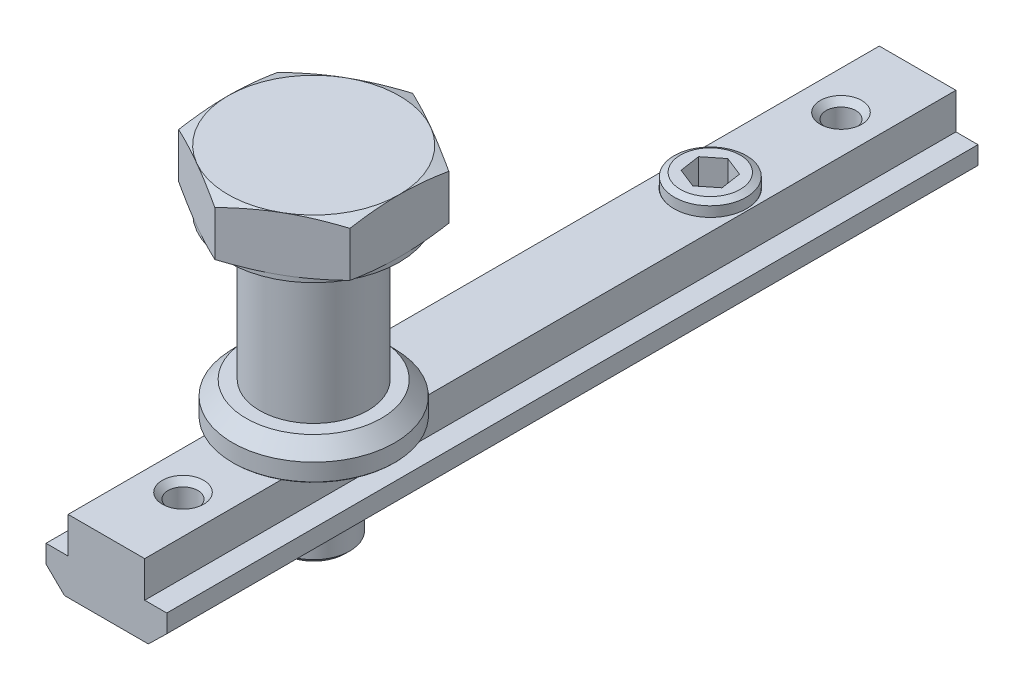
ISO-10303-21;
HEADER;
FILE_DESCRIPTION(('STEP AP214'),'2;1');
FILE_NAME('part.step','',(''),(''),'','','');
FILE_SCHEMA(('AUTOMOTIVE_DESIGN { 1 0 10303 214 1 1 1 1 }'));
ENDSEC;
DATA;
#1=APPLICATION_CONTEXT('core data for automotive mechanical design processes');
#2=APPLICATION_PROTOCOL_DEFINITION('international standard','automotive_design',2000,#1);
#3=PRODUCT_CONTEXT('',#1,'mechanical');
#4=PRODUCT('Part','Part','',(#3));
#5=PRODUCT_RELATED_PRODUCT_CATEGORY('part','',(#4));
#6=PRODUCT_DEFINITION_FORMATION('','',#4);
#7=PRODUCT_DEFINITION_CONTEXT('part definition',#1,'design');
#8=PRODUCT_DEFINITION('design','',#6,#7);
#9=PRODUCT_DEFINITION_SHAPE('','',#8);
#10=(LENGTH_UNIT() NAMED_UNIT(*) SI_UNIT(.MILLI.,.METRE.));
#11=(NAMED_UNIT(*) PLANE_ANGLE_UNIT() SI_UNIT($,.RADIAN.));
#12=(NAMED_UNIT(*) SI_UNIT($,.STERADIAN.) SOLID_ANGLE_UNIT());
#13=UNCERTAINTY_MEASURE_WITH_UNIT(LENGTH_MEASURE(1.E-05),#10,'distance_accuracy_value','');
#14=(GEOMETRIC_REPRESENTATION_CONTEXT(3) GLOBAL_UNCERTAINTY_ASSIGNED_CONTEXT((#13)) GLOBAL_UNIT_ASSIGNED_CONTEXT((#10,
#11,#12)) REPRESENTATION_CONTEXT('',''));
#15=CARTESIAN_POINT('',(0.,0.,0.));
#16=DIRECTION('',(0.,0.,1.));
#17=DIRECTION('',(1.,0.,0.));
#18=AXIS2_PLACEMENT_3D('',#15,#16,#17);
#19=CARTESIAN_POINT('',(-4.65,-8.,-45.));
#20=DIRECTION('',(0.,-1.,0.));
#21=DIRECTION('',(0.,0.,-1.));
#22=AXIS2_PLACEMENT_3D('',#19,#20,#21);
#23=PLANE('',#22);
#24=CARTESIAN_POINT('',(0.,-8.,-22.));
#25=DIRECTION('',(0.,-1.,0.));
#26=DIRECTION('',(0.,0.,-1.));
#27=AXIS2_PLACEMENT_3D('',#24,#25,#26);
#28=CIRCLE('',#27,4.65);
#29=CARTESIAN_POINT('',(4.65,-8.,-22.));
#30=VERTEX_POINT('',#29);
#31=CARTESIAN_POINT('',(-4.65,-8.,-22.));
#32=VERTEX_POINT('',#31);
#33=EDGE_CURVE('P0_E11',#30,#32,#28,.T.);
#34=ORIENTED_EDGE('',*,*,#33,.F.);
#35=DIRECTION('',(0.,0.,1.));
#36=VECTOR('',#35,1.);
#37=CARTESIAN_POINT('',(4.65,-8.,-45.));
#38=LINE('',#37,#36);
#39=CARTESIAN_POINT('',(4.65,-8.,22.));
#40=VERTEX_POINT('',#39);
#41=EDGE_CURVE('P0_E114',#30,#40,#38,.T.);
#42=ORIENTED_EDGE('',*,*,#41,.T.);
#43=CARTESIAN_POINT('',(0.,-8.,22.));
#44=DIRECTION('',(0.,1.,0.));
#45=DIRECTION('',(0.,0.,1.));
#46=AXIS2_PLACEMENT_3D('',#43,#44,#45);
#47=CIRCLE('',#46,4.65);
#48=CARTESIAN_POINT('',(-4.65000000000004,-7.99999999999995,22.));
#49=VERTEX_POINT('',#48);
#50=EDGE_CURVE('P0_E390',#40,#49,#47,.T.);
#51=ORIENTED_EDGE('',*,*,#50,.T.);
#52=DIRECTION('',(0.,0.,1.));
#53=VECTOR('',#52,1.);
#54=CARTESIAN_POINT('',(-4.65,-8.,-45.));
#55=LINE('',#54,#53);
#56=EDGE_CURVE('P0_E38',#32,#49,#55,.T.);
#57=ORIENTED_EDGE('',*,*,#56,.F.);
#58=EDGE_LOOP('',(#34,#42,#51,#57));
#59=FACE_BOUND('',#58,.T.);
#60=ADVANCED_FACE('P0_F17',(#59),#23,.T.);
#61=EDGE_CURVE('P0_E389',#49,#40,#47,.T.);
#62=ORIENTED_EDGE('',*,*,#61,.T.);
#63=CARTESIAN_POINT('',(4.65,-8.,45.));
#64=VERTEX_POINT('',#63);
#65=EDGE_CURVE('P0_E123',#40,#64,#38,.T.);
#66=ORIENTED_EDGE('',*,*,#65,.T.);
#67=DIRECTION('',(1.,0.,0.));
#68=VECTOR('',#67,1.);
#69=CARTESIAN_POINT('',(-4.65,-8.,45.));
#70=LINE('',#69,#68);
#71=CARTESIAN_POINT('',(-4.65,-8.,45.));
#72=VERTEX_POINT('',#71);
#73=EDGE_CURVE('P0_E213',#72,#64,#70,.T.);
#74=ORIENTED_EDGE('',*,*,#73,.F.);
#75=EDGE_CURVE('P0_E143',#49,#72,#55,.T.);
#76=ORIENTED_EDGE('',*,*,#75,.F.);
#77=EDGE_LOOP('',(#62,#66,#74,#76));
#78=FACE_BOUND('',#77,.T.);
#79=CARTESIAN_POINT('',(0.,-8.,36.5));
#80=DIRECTION('',(0.,1.,0.));
#81=DIRECTION('',(0.,0.,1.));
#82=AXIS2_PLACEMENT_3D('',#79,#80,#81);
#83=CIRCLE('',#82,2.5);
#84=CARTESIAN_POINT('',(0.,-8.,39.));
#85=VERTEX_POINT('',#84);
#86=EDGE_CURVE('P0_E405',#85,#85,#83,.T.);
#87=ORIENTED_EDGE('',*,*,#86,.T.);
#88=EDGE_LOOP('',(#87));
#89=FACE_BOUND('',#88,.T.);
#90=ADVANCED_FACE('P0_F292',(#78,#89),#23,.T.);
#91=CARTESIAN_POINT('',(4.25,-4.,-45.));
#92=DIRECTION('',(0.,1.,0.));
#93=DIRECTION('',(0.,0.,1.));
#94=AXIS2_PLACEMENT_3D('',#91,#92,#93);
#95=PLANE('',#94);
#96=DIRECTION('',(-1.,0.,0.));
#97=VECTOR('',#96,1.);
#98=CARTESIAN_POINT('',(4.25,-4.,45.));
#99=LINE('',#98,#97);
#100=CARTESIAN_POINT('',(6.7,-4.,45.));
#101=VERTEX_POINT('',#100);
#102=CARTESIAN_POINT('',(4.25,-4.,45.));
#103=VERTEX_POINT('',#102);
#104=EDGE_CURVE('P0_E184',#101,#103,#99,.T.);
#105=ORIENTED_EDGE('',*,*,#104,.F.);
#106=DIRECTION('',(0.,0.,1.));
#107=VECTOR('',#106,1.);
#108=CARTESIAN_POINT('',(6.7,-4.,-45.));
#109=LINE('',#108,#107);
#110=CARTESIAN_POINT('',(6.7,-4.,-45.));
#111=VERTEX_POINT('',#110);
#112=EDGE_CURVE('P0_E26',#111,#101,#109,.T.);
#113=ORIENTED_EDGE('',*,*,#112,.F.);
#114=DIRECTION('',(-1.,0.,0.));
#115=VECTOR('',#114,1.);
#116=CARTESIAN_POINT('',(4.25,-4.,-45.));
#117=LINE('',#116,#115);
#118=CARTESIAN_POINT('',(4.25,-4.,-45.));
#119=VERTEX_POINT('',#118);
#120=EDGE_CURVE('P0_E225',#111,#119,#117,.T.);
#121=ORIENTED_EDGE('',*,*,#120,.T.);
#122=DIRECTION('',(0.,0.,1.));
#123=VECTOR('',#122,1.);
#124=CARTESIAN_POINT('',(4.25,-4.,-45.));
#125=LINE('',#124,#123);
#126=EDGE_CURVE('P0_E167',#119,#103,#125,.T.);
#127=ORIENTED_EDGE('',*,*,#126,.T.);
#128=EDGE_LOOP('',(#105,#113,#121,#127));
#129=FACE_BOUND('',#128,.T.);
#130=ADVANCED_FACE('P0_F19',(#129),#95,.T.);
#131=CARTESIAN_POINT('',(6.7,-6.,-45.));
#132=DIRECTION('',(1.,0.,0.));
#133=DIRECTION('',(0.,1.,0.));
#134=AXIS2_PLACEMENT_3D('',#131,#132,#133);
#135=PLANE('',#134);
#136=DIRECTION('',(0.,1.,0.));
#137=VECTOR('',#136,1.);
#138=CARTESIAN_POINT('',(6.7,-6.,45.));
#139=LINE('',#138,#137);
#140=CARTESIAN_POINT('',(6.7,-6.,45.));
#141=VERTEX_POINT('',#140);
#142=EDGE_CURVE('P0_E221',#141,#101,#139,.T.);
#143=ORIENTED_EDGE('',*,*,#142,.F.);
#144=DIRECTION('',(0.,0.,1.));
#145=VECTOR('',#144,1.);
#146=CARTESIAN_POINT('',(6.7,-6.,-45.));
#147=LINE('',#146,#145);
#148=CARTESIAN_POINT('',(6.7,-6.,-45.));
#149=VERTEX_POINT('',#148);
#150=EDGE_CURVE('P0_E132',#149,#141,#147,.T.);
#151=ORIENTED_EDGE('',*,*,#150,.F.);
#152=DIRECTION('',(0.,1.,0.));
#153=VECTOR('',#152,1.);
#154=CARTESIAN_POINT('',(6.7,-6.,-45.));
#155=LINE('',#154,#153);
#156=EDGE_CURVE('P0_E169',#149,#111,#155,.T.);
#157=ORIENTED_EDGE('',*,*,#156,.T.);
#158=ORIENTED_EDGE('',*,*,#112,.T.);
#159=EDGE_LOOP('',(#143,#151,#157,#158));
#160=FACE_BOUND('',#159,.T.);
#161=ADVANCED_FACE('P0_F228',(#160),#135,.T.);
#162=CARTESIAN_POINT('',(4.65,-8.,-45.));
#163=DIRECTION('',(0.698323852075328,-0.715781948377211,0.));
#164=DIRECTION('',(0.715781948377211,0.698323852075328,0.));
#165=AXIS2_PLACEMENT_3D('',#162,#163,#164);
#166=PLANE('',#165);
#167=DIRECTION('',(0.715781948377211,0.698323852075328,0.));
#168=VECTOR('',#167,1.);
#169=CARTESIAN_POINT('',(4.65,-8.,45.));
#170=LINE('',#169,#168);
#171=EDGE_CURVE('P0_E217',#64,#141,#170,.T.);
#172=ORIENTED_EDGE('',*,*,#171,.F.);
#173=ORIENTED_EDGE('',*,*,#65,.F.);
#174=ORIENTED_EDGE('',*,*,#41,.F.);
#175=CARTESIAN_POINT('',(4.65,-8.,-45.));
#176=VERTEX_POINT('',#175);
#177=EDGE_CURVE('P0_E121',#176,#30,#38,.T.);
#178=ORIENTED_EDGE('',*,*,#177,.F.);
#179=DIRECTION('',(0.715781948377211,0.698323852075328,0.));
#180=VECTOR('',#179,1.);
#181=CARTESIAN_POINT('',(4.65,-8.,-45.));
#182=LINE('',#181,#180);
#183=EDGE_CURVE('P0_E176',#176,#149,#182,.T.);
#184=ORIENTED_EDGE('',*,*,#183,.T.);
#185=ORIENTED_EDGE('',*,*,#150,.T.);
#186=EDGE_LOOP('',(#172,#173,#174,#178,#184,#185));
#187=FACE_BOUND('',#186,.T.);
#188=ADVANCED_FACE('P0_F119',(#187),#166,.T.);
#189=CARTESIAN_POINT('',(0.,-8.,-22.));
#190=DIRECTION('',(0.,1.,0.));
#191=DIRECTION('',(0.,0.,1.));
#192=AXIS2_PLACEMENT_3D('',#189,#190,#191);
#193=CIRCLE('',#192,4.65);
#194=EDGE_CURVE('P0_E103',#30,#32,#193,.T.);
#195=ORIENTED_EDGE('',*,*,#194,.T.);
#196=CARTESIAN_POINT('',(-4.65,-8.,-45.));
#197=VERTEX_POINT('',#196);
#198=EDGE_CURVE('P0_E138',#197,#32,#55,.T.);
#199=ORIENTED_EDGE('',*,*,#198,.F.);
#200=DIRECTION('',(1.,0.,0.));
#201=VECTOR('',#200,1.);
#202=CARTESIAN_POINT('',(-4.65,-8.,-45.));
#203=LINE('',#202,#201);
#204=EDGE_CURVE('P0_E130',#197,#176,#203,.T.);
#205=ORIENTED_EDGE('',*,*,#204,.T.);
#206=ORIENTED_EDGE('',*,*,#177,.T.);
#207=EDGE_LOOP('',(#195,#199,#205,#206));
#208=FACE_BOUND('',#207,.T.);
#209=CARTESIAN_POINT('',(0.,-8.,-36.5));
#210=DIRECTION('',(0.,1.,0.));
#211=DIRECTION('',(0.,0.,1.));
#212=AXIS2_PLACEMENT_3D('',#209,#210,#211);
#213=CIRCLE('',#212,2.5);
#214=CARTESIAN_POINT('',(0.,-8.,-34.));
#215=VERTEX_POINT('',#214);
#216=EDGE_CURVE('P0_E373',#215,#215,#213,.T.);
#217=ORIENTED_EDGE('',*,*,#216,.T.);
#218=EDGE_LOOP('',(#217));
#219=FACE_BOUND('',#218,.T.);
#220=ADVANCED_FACE('P0_F127',(#208,#219),#23,.T.);
#221=CARTESIAN_POINT('',(-6.7,-6.,-45.));
#222=DIRECTION('',(-0.698323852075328,-0.715781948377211,0.));
#223=DIRECTION('',(0.715781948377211,-0.698323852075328,0.));
#224=AXIS2_PLACEMENT_3D('',#221,#222,#223);
#225=PLANE('',#224);
#226=DIRECTION('',(0.715781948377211,-0.698323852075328,0.));
#227=VECTOR('',#226,1.);
#228=CARTESIAN_POINT('',(-6.7,-6.,45.));
#229=LINE('',#228,#227);
#230=CARTESIAN_POINT('',(-6.7,-6.,45.));
#231=VERTEX_POINT('',#230);
#232=EDGE_CURVE('P0_E209',#231,#72,#229,.T.);
#233=ORIENTED_EDGE('',*,*,#232,.F.);
#234=DIRECTION('',(0.,0.,1.));
#235=VECTOR('',#234,1.);
#236=CARTESIAN_POINT('',(-6.7,-6.,-45.));
#237=LINE('',#236,#235);
#238=CARTESIAN_POINT('',(-6.7,-6.,-45.));
#239=VERTEX_POINT('',#238);
#240=EDGE_CURVE('P0_E148',#239,#231,#237,.T.);
#241=ORIENTED_EDGE('',*,*,#240,.F.);
#242=DIRECTION('',(0.715781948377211,-0.698323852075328,0.));
#243=VECTOR('',#242,1.);
#244=CARTESIAN_POINT('',(-6.7,-6.,-45.));
#245=LINE('',#244,#243);
#246=EDGE_CURVE('P0_E260',#239,#197,#245,.T.);
#247=ORIENTED_EDGE('',*,*,#246,.T.);
#248=ORIENTED_EDGE('',*,*,#198,.T.);
#249=ORIENTED_EDGE('',*,*,#56,.T.);
#250=ORIENTED_EDGE('',*,*,#75,.T.);
#251=EDGE_LOOP('',(#233,#241,#247,#248,#249,#250));
#252=FACE_BOUND('',#251,.T.);
#253=ADVANCED_FACE('P0_F266',(#252),#225,.T.);
#254=CARTESIAN_POINT('',(-6.7,-4.,-45.));
#255=DIRECTION('',(-1.,0.,0.));
#256=DIRECTION('',(0.,-1.,0.));
#257=AXIS2_PLACEMENT_3D('',#254,#255,#256);
#258=PLANE('',#257);
#259=DIRECTION('',(0.,-1.,0.));
#260=VECTOR('',#259,1.);
#261=CARTESIAN_POINT('',(-6.7,-4.,45.));
#262=LINE('',#261,#260);
#263=CARTESIAN_POINT('',(-6.7,-4.,45.));
#264=VERTEX_POINT('',#263);
#265=EDGE_CURVE('P0_E205',#264,#231,#262,.T.);
#266=ORIENTED_EDGE('',*,*,#265,.F.);
#267=DIRECTION('',(0.,0.,1.));
#268=VECTOR('',#267,1.);
#269=CARTESIAN_POINT('',(-6.7,-4.,-45.));
#270=LINE('',#269,#268);
#271=CARTESIAN_POINT('',(-6.7,-4.,-45.));
#272=VERTEX_POINT('',#271);
#273=EDGE_CURVE('P0_E152',#272,#264,#270,.T.);
#274=ORIENTED_EDGE('',*,*,#273,.F.);
#275=DIRECTION('',(0.,-1.,0.));
#276=VECTOR('',#275,1.);
#277=CARTESIAN_POINT('',(-6.7,-4.,-45.));
#278=LINE('',#277,#276);
#279=EDGE_CURVE('P0_E257',#272,#239,#278,.T.);
#280=ORIENTED_EDGE('',*,*,#279,.T.);
#281=ORIENTED_EDGE('',*,*,#240,.T.);
#282=EDGE_LOOP('',(#266,#274,#280,#281));
#283=FACE_BOUND('',#282,.T.);
#284=ADVANCED_FACE('P0_F269',(#283),#258,.T.);
#285=CARTESIAN_POINT('',(-4.25,-4.,-45.));
#286=DIRECTION('',(0.,1.,0.));
#287=DIRECTION('',(0.,0.,1.));
#288=AXIS2_PLACEMENT_3D('',#285,#286,#287);
#289=PLANE('',#288);
#290=DIRECTION('',(-1.,0.,0.));
#291=VECTOR('',#290,1.);
#292=CARTESIAN_POINT('',(-4.25,-4.,45.));
#293=LINE('',#292,#291);
#294=CARTESIAN_POINT('',(-4.25,-4.,45.));
#295=VERTEX_POINT('',#294);
#296=EDGE_CURVE('P0_E201',#295,#264,#293,.T.);
#297=ORIENTED_EDGE('',*,*,#296,.F.);
#298=DIRECTION('',(0.,0.,1.));
#299=VECTOR('',#298,1.);
#300=CARTESIAN_POINT('',(-4.25,-4.,-45.));
#301=LINE('',#300,#299);
#302=CARTESIAN_POINT('',(-4.25,-4.,-45.));
#303=VERTEX_POINT('',#302);
#304=EDGE_CURVE('P0_E157',#303,#295,#301,.T.);
#305=ORIENTED_EDGE('',*,*,#304,.F.);
#306=DIRECTION('',(-1.,0.,0.));
#307=VECTOR('',#306,1.);
#308=CARTESIAN_POINT('',(-4.25,-4.,-45.));
#309=LINE('',#308,#307);
#310=EDGE_CURVE('P0_E253',#303,#272,#309,.T.);
#311=ORIENTED_EDGE('',*,*,#310,.T.);
#312=ORIENTED_EDGE('',*,*,#273,.T.);
#313=EDGE_LOOP('',(#297,#305,#311,#312));
#314=FACE_BOUND('',#313,.T.);
#315=ADVANCED_FACE('P0_F272',(#314),#289,.T.);
#316=CARTESIAN_POINT('',(-4.25,0.,-45.));
#317=DIRECTION('',(-1.,0.,0.));
#318=DIRECTION('',(0.,-1.,0.));
#319=AXIS2_PLACEMENT_3D('',#316,#317,#318);
#320=PLANE('',#319);
#321=DIRECTION('',(0.,-1.,0.));
#322=VECTOR('',#321,1.);
#323=CARTESIAN_POINT('',(-4.25,0.,45.));
#324=LINE('',#323,#322);
#325=CARTESIAN_POINT('',(-4.25,0.,45.));
#326=VERTEX_POINT('',#325);
#327=EDGE_CURVE('P0_E197',#326,#295,#324,.T.);
#328=ORIENTED_EDGE('',*,*,#327,.F.);
#329=DIRECTION('',(0.,0.,1.));
#330=VECTOR('',#329,1.);
#331=CARTESIAN_POINT('',(-4.25,0.,-45.));
#332=LINE('',#331,#330);
#333=CARTESIAN_POINT('',(-4.25,0.,-45.));
#334=VERTEX_POINT('',#333);
#335=EDGE_CURVE('P0_E162',#334,#326,#332,.T.);
#336=ORIENTED_EDGE('',*,*,#335,.F.);
#337=DIRECTION('',(0.,-1.,0.));
#338=VECTOR('',#337,1.);
#339=CARTESIAN_POINT('',(-4.25,0.,-45.));
#340=LINE('',#339,#338);
#341=EDGE_CURVE('P0_E249',#334,#303,#340,.T.);
#342=ORIENTED_EDGE('',*,*,#341,.T.);
#343=ORIENTED_EDGE('',*,*,#304,.T.);
#344=EDGE_LOOP('',(#328,#336,#342,#343));
#345=FACE_BOUND('',#344,.T.);
#346=ADVANCED_FACE('P0_F276',(#345),#320,.T.);
#347=CARTESIAN_POINT('',(-4.25,0.,-45.));
#348=DIRECTION('',(0.,1.,0.));
#349=DIRECTION('',(0.,0.,1.));
#350=AXIS2_PLACEMENT_3D('',#347,#348,#349);
#351=PLANE('',#350);
#352=CARTESIAN_POINT('',(0.,0.,-22.));
#353=DIRECTION('',(0.,1.,0.));
#354=DIRECTION('',(0.,0.,1.));
#355=AXIS2_PLACEMENT_3D('',#352,#353,#354);
#356=CIRCLE('',#355,4.025);
#357=CARTESIAN_POINT('',(0.,0.,-17.975));
#358=VERTEX_POINT('',#357);
#359=EDGE_CURVE('P0_E109',#358,#358,#356,.T.);
#360=ORIENTED_EDGE('',*,*,#359,.F.);
#361=EDGE_LOOP('',(#360));
#362=FACE_BOUND('',#361,.T.);
#363=CARTESIAN_POINT('',(0.,0.,-36.5));
#364=DIRECTION('',(0.,1.,0.));
#365=DIRECTION('',(0.,0.,1.));
#366=AXIS2_PLACEMENT_3D('',#363,#364,#365);
#367=CIRCLE('',#366,2.3);
#368=CARTESIAN_POINT('',(0.,0.,-34.2));
#369=VERTEX_POINT('',#368);
#370=EDGE_CURVE('P0_E377',#369,#369,#367,.T.);
#371=ORIENTED_EDGE('',*,*,#370,.F.);
#372=EDGE_LOOP('',(#371));
#373=FACE_BOUND('',#372,.T.);
#374=CARTESIAN_POINT('',(0.,0.,22.));
#375=DIRECTION('',(0.,1.,0.));
#376=DIRECTION('',(0.,0.,1.));
#377=AXIS2_PLACEMENT_3D('',#374,#375,#376);
#378=CIRCLE('',#377,4.025);
#379=CARTESIAN_POINT('',(0.,0.,26.025));
#380=VERTEX_POINT('',#379);
#381=EDGE_CURVE('P0_E393',#380,#380,#378,.T.);
#382=ORIENTED_EDGE('',*,*,#381,.F.);
#383=EDGE_LOOP('',(#382));
#384=FACE_BOUND('',#383,.T.);
#385=CARTESIAN_POINT('',(0.,0.,36.5));
#386=DIRECTION('',(0.,1.,0.));
#387=DIRECTION('',(0.,0.,1.));
#388=AXIS2_PLACEMENT_3D('',#385,#386,#387);
#389=CIRCLE('',#388,2.3);
#390=CARTESIAN_POINT('',(0.,0.,38.8));
#391=VERTEX_POINT('',#390);
#392=EDGE_CURVE('P0_E409',#391,#391,#389,.T.);
#393=ORIENTED_EDGE('',*,*,#392,.F.);
#394=EDGE_LOOP('',(#393));
#395=FACE_BOUND('',#394,.T.);
#396=DIRECTION('',(-1.,0.,0.));
#397=VECTOR('',#396,1.);
#398=CARTESIAN_POINT('',(-4.25,0.,45.));
#399=LINE('',#398,#397);
#400=CARTESIAN_POINT('',(4.25,0.,45.));
#401=VERTEX_POINT('',#400);
#402=EDGE_CURVE('P0_E193',#401,#326,#399,.T.);
#403=ORIENTED_EDGE('',*,*,#402,.F.);
#404=DIRECTION('',(0.,0.,1.));
#405=VECTOR('',#404,1.);
#406=CARTESIAN_POINT('',(4.25,0.,-45.));
#407=LINE('',#406,#405);
#408=CARTESIAN_POINT('',(4.25,0.,-45.));
#409=VERTEX_POINT('',#408);
#410=EDGE_CURVE('P0_E165',#409,#401,#407,.T.);
#411=ORIENTED_EDGE('',*,*,#410,.F.);
#412=DIRECTION('',(-1.,0.,0.));
#413=VECTOR('',#412,1.);
#414=CARTESIAN_POINT('',(-4.25,0.,-45.));
#415=LINE('',#414,#413);
#416=EDGE_CURVE('P0_E241',#409,#334,#415,.T.);
#417=ORIENTED_EDGE('',*,*,#416,.T.);
#418=ORIENTED_EDGE('',*,*,#335,.T.);
#419=EDGE_LOOP('',(#403,#411,#417,#418));
#420=FACE_BOUND('',#419,.T.);
#421=ADVANCED_FACE('P0_F279',(#362,#373,#384,#395,#420),#351,.T.);
#422=CARTESIAN_POINT('',(4.25,0.,-45.));
#423=DIRECTION('',(1.,0.,0.));
#424=DIRECTION('',(0.,1.,0.));
#425=AXIS2_PLACEMENT_3D('',#422,#423,#424);
#426=PLANE('',#425);
#427=DIRECTION('',(0.,1.,0.));
#428=VECTOR('',#427,1.);
#429=CARTESIAN_POINT('',(4.25,0.,45.));
#430=LINE('',#429,#428);
#431=EDGE_CURVE('P0_E188',#103,#401,#430,.T.);
#432=ORIENTED_EDGE('',*,*,#431,.F.);
#433=ORIENTED_EDGE('',*,*,#126,.F.);
#434=DIRECTION('',(0.,1.,0.));
#435=VECTOR('',#434,1.);
#436=CARTESIAN_POINT('',(4.25,0.,-45.));
#437=LINE('',#436,#435);
#438=EDGE_CURVE('P0_E237',#119,#409,#437,.T.);
#439=ORIENTED_EDGE('',*,*,#438,.T.);
#440=ORIENTED_EDGE('',*,*,#410,.T.);
#441=EDGE_LOOP('',(#432,#433,#439,#440));
#442=FACE_BOUND('',#441,.T.);
#443=ADVANCED_FACE('P0_F281',(#442),#426,.T.);
#444=CARTESIAN_POINT('',(0.,0.,-45.));
#445=DIRECTION('',(0.,0.,1.));
#446=DIRECTION('',(1.,0.,0.));
#447=AXIS2_PLACEMENT_3D('',#444,#445,#446);
#448=PLANE('',#447);
#449=ORIENTED_EDGE('',*,*,#120,.F.);
#450=ORIENTED_EDGE('',*,*,#156,.F.);
#451=ORIENTED_EDGE('',*,*,#183,.F.);
#452=ORIENTED_EDGE('',*,*,#204,.F.);
#453=ORIENTED_EDGE('',*,*,#246,.F.);
#454=ORIENTED_EDGE('',*,*,#279,.F.);
#455=ORIENTED_EDGE('',*,*,#310,.F.);
#456=ORIENTED_EDGE('',*,*,#341,.F.);
#457=ORIENTED_EDGE('',*,*,#416,.F.);
#458=ORIENTED_EDGE('',*,*,#438,.F.);
#459=EDGE_LOOP('',(#449,#450,#451,#452,#453,#454,#455,#456,#457,#458));
#460=FACE_BOUND('',#459,.T.);
#461=ADVANCED_FACE('P0_F233',(#460),#448,.F.);
#462=CARTESIAN_POINT('',(0.,0.,45.));
#463=DIRECTION('',(0.,0.,1.));
#464=DIRECTION('',(1.,0.,0.));
#465=AXIS2_PLACEMENT_3D('',#462,#463,#464);
#466=PLANE('',#465);
#467=ORIENTED_EDGE('',*,*,#104,.T.);
#468=ORIENTED_EDGE('',*,*,#431,.T.);
#469=ORIENTED_EDGE('',*,*,#402,.T.);
#470=ORIENTED_EDGE('',*,*,#327,.T.);
#471=ORIENTED_EDGE('',*,*,#296,.T.);
#472=ORIENTED_EDGE('',*,*,#265,.T.);
#473=ORIENTED_EDGE('',*,*,#232,.T.);
#474=ORIENTED_EDGE('',*,*,#73,.T.);
#475=ORIENTED_EDGE('',*,*,#171,.T.);
#476=ORIENTED_EDGE('',*,*,#142,.T.);
#477=EDGE_LOOP('',(#467,#468,#469,#470,#471,#472,#473,#474,#475,#476));
#478=FACE_BOUND('',#477,.T.);
#479=ADVANCED_FACE('P0_F231',(#478),#466,.T.);
#480=CARTESIAN_POINT('',(0.,-7.15,36.5));
#481=DIRECTION('',(0.,-1.,0.));
#482=DIRECTION('',(0.,0.,-1.));
#483=AXIS2_PLACEMENT_3D('',#480,#481,#482);
#484=CONICAL_SURFACE('',#483,1.65,0.785398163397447);
#485=ORIENTED_EDGE('',*,*,#86,.F.);
#486=EDGE_LOOP('',(#485));
#487=FACE_BOUND('',#486,.T.);
#488=CARTESIAN_POINT('',(0.,-7.15,36.5));
#489=DIRECTION('',(0.,1.,0.));
#490=DIRECTION('',(0.,0.,1.));
#491=AXIS2_PLACEMENT_3D('',#488,#489,#490);
#492=CIRCLE('',#491,1.65);
#493=CARTESIAN_POINT('',(0.,-7.15,38.15));
#494=VERTEX_POINT('',#493);
#495=EDGE_CURVE('P0_E189',#494,#494,#492,.T.);
#496=ORIENTED_EDGE('',*,*,#495,.T.);
#497=EDGE_LOOP('',(#496));
#498=FACE_BOUND('',#497,.T.);
#499=ADVANCED_FACE('P0_F310',(#487,#498),#484,.F.);
#500=CARTESIAN_POINT('',(0.,0.,36.5));
#501=DIRECTION('',(0.,1.,0.));
#502=DIRECTION('',(0.,0.,1.));
#503=AXIS2_PLACEMENT_3D('',#500,#501,#502);
#504=CYLINDRICAL_SURFACE('',#503,1.65);
#505=ORIENTED_EDGE('',*,*,#495,.F.);
#506=EDGE_LOOP('',(#505));
#507=FACE_BOUND('',#506,.T.);
#508=CARTESIAN_POINT('',(0.,-0.65,36.5));
#509=DIRECTION('',(0.,1.,0.));
#510=DIRECTION('',(0.,0.,1.));
#511=AXIS2_PLACEMENT_3D('',#508,#509,#510);
#512=CIRCLE('',#511,1.65);
#513=CARTESIAN_POINT('',(0.,-0.65,38.15));
#514=VERTEX_POINT('',#513);
#515=EDGE_CURVE('P0_E412',#514,#514,#512,.T.);
#516=ORIENTED_EDGE('',*,*,#515,.T.);
#517=EDGE_LOOP('',(#516));
#518=FACE_BOUND('',#517,.T.);
#519=ADVANCED_FACE('P0_F314',(#507,#518),#504,.F.);
#520=CARTESIAN_POINT('',(0.,0.,36.5));
#521=DIRECTION('',(0.,1.,0.));
#522=DIRECTION('',(0.,0.,1.));
#523=AXIS2_PLACEMENT_3D('',#520,#521,#522);
#524=CONICAL_SURFACE('',#523,2.3,0.785398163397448);
#525=ORIENTED_EDGE('',*,*,#515,.F.);
#526=EDGE_LOOP('',(#525));
#527=FACE_BOUND('',#526,.T.);
#528=ORIENTED_EDGE('',*,*,#392,.T.);
#529=EDGE_LOOP('',(#528));
#530=FACE_BOUND('',#529,.T.);
#531=ADVANCED_FACE('P0_F318',(#527,#530),#524,.F.);
#532=CARTESIAN_POINT('',(0.,-6.75,22.));
#533=DIRECTION('',(0.,-1.,0.));
#534=DIRECTION('',(0.,0.,-1.));
#535=AXIS2_PLACEMENT_3D('',#532,#533,#534);
#536=CONICAL_SURFACE('',#535,3.4,0.785398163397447);
#537=ORIENTED_EDGE('',*,*,#50,.F.);
#538=ORIENTED_EDGE('',*,*,#61,.F.);
#539=EDGE_LOOP('',(#537,#538));
#540=FACE_BOUND('',#539,.T.);
#541=CARTESIAN_POINT('',(0.,-6.75,22.));
#542=DIRECTION('',(0.,1.,0.));
#543=DIRECTION('',(0.,0.,1.));
#544=AXIS2_PLACEMENT_3D('',#541,#542,#543);
#545=CIRCLE('',#544,3.4);
#546=CARTESIAN_POINT('',(0.,-6.75,25.4));
#547=VERTEX_POINT('',#546);
#548=EDGE_CURVE('P0_E401',#547,#547,#545,.T.);
#549=ORIENTED_EDGE('',*,*,#548,.T.);
#550=EDGE_LOOP('',(#549));
#551=FACE_BOUND('',#550,.T.);
#552=ADVANCED_FACE('P0_F322',(#540,#551),#536,.F.);
#553=CARTESIAN_POINT('',(0.,0.,22.));
#554=DIRECTION('',(0.,1.,0.));
#555=DIRECTION('',(0.,0.,1.));
#556=AXIS2_PLACEMENT_3D('',#553,#554,#555);
#557=CYLINDRICAL_SURFACE('',#556,3.4);
#558=ORIENTED_EDGE('',*,*,#548,.F.);
#559=EDGE_LOOP('',(#558));
#560=FACE_BOUND('',#559,.T.);
#561=CARTESIAN_POINT('',(0.,-0.625000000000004,22.));
#562=DIRECTION('',(0.,1.,0.));
#563=DIRECTION('',(0.,0.,1.));
#564=AXIS2_PLACEMENT_3D('',#561,#562,#563);
#565=CIRCLE('',#564,3.4);
#566=CARTESIAN_POINT('',(0.,-0.625000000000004,25.4));
#567=VERTEX_POINT('',#566);
#568=EDGE_CURVE('P0_E397',#567,#567,#565,.T.);
#569=ORIENTED_EDGE('',*,*,#568,.T.);
#570=EDGE_LOOP('',(#569));
#571=FACE_BOUND('',#570,.T.);
#572=ADVANCED_FACE('P0_F326',(#560,#571),#557,.F.);
#573=CARTESIAN_POINT('',(0.,0.,22.));
#574=DIRECTION('',(0.,1.,0.));
#575=DIRECTION('',(0.,0.,1.));
#576=AXIS2_PLACEMENT_3D('',#573,#574,#575);
#577=CONICAL_SURFACE('',#576,4.025,0.785398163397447);
#578=ORIENTED_EDGE('',*,*,#568,.F.);
#579=EDGE_LOOP('',(#578));
#580=FACE_BOUND('',#579,.T.);
#581=ORIENTED_EDGE('',*,*,#381,.T.);
#582=EDGE_LOOP('',(#581));
#583=FACE_BOUND('',#582,.T.);
#584=ADVANCED_FACE('P0_F330',(#580,#583),#577,.F.);
#585=CARTESIAN_POINT('',(0.,-7.15,-36.5));
#586=DIRECTION('',(0.,-1.,0.));
#587=DIRECTION('',(0.,0.,-1.));
#588=AXIS2_PLACEMENT_3D('',#585,#586,#587);
#589=CONICAL_SURFACE('',#588,1.65,0.785398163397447);
#590=ORIENTED_EDGE('',*,*,#216,.F.);
#591=EDGE_LOOP('',(#590));
#592=FACE_BOUND('',#591,.T.);
#593=CARTESIAN_POINT('',(0.,-7.15,-36.5));
#594=DIRECTION('',(0.,1.,0.));
#595=DIRECTION('',(0.,0.,1.));
#596=AXIS2_PLACEMENT_3D('',#593,#594,#595);
#597=CIRCLE('',#596,1.65);
#598=CARTESIAN_POINT('',(0.,-7.15,-34.85));
#599=VERTEX_POINT('',#598);
#600=EDGE_CURVE('P0_E385',#599,#599,#597,.T.);
#601=ORIENTED_EDGE('',*,*,#600,.T.);
#602=EDGE_LOOP('',(#601));
#603=FACE_BOUND('',#602,.T.);
#604=ADVANCED_FACE('P0_F334',(#592,#603),#589,.F.);
#605=CARTESIAN_POINT('',(0.,0.,-36.5));
#606=DIRECTION('',(0.,1.,0.));
#607=DIRECTION('',(0.,0.,1.));
#608=AXIS2_PLACEMENT_3D('',#605,#606,#607);
#609=CYLINDRICAL_SURFACE('',#608,1.65);
#610=ORIENTED_EDGE('',*,*,#600,.F.);
#611=EDGE_LOOP('',(#610));
#612=FACE_BOUND('',#611,.T.);
#613=CARTESIAN_POINT('',(0.,-0.65,-36.5));
#614=DIRECTION('',(0.,1.,0.));
#615=DIRECTION('',(0.,0.,1.));
#616=AXIS2_PLACEMENT_3D('',#613,#614,#615);
#617=CIRCLE('',#616,1.65);
#618=CARTESIAN_POINT('',(0.,-0.65,-34.85));
#619=VERTEX_POINT('',#618);
#620=EDGE_CURVE('P0_E381',#619,#619,#617,.T.);
#621=ORIENTED_EDGE('',*,*,#620,.T.);
#622=EDGE_LOOP('',(#621));
#623=FACE_BOUND('',#622,.T.);
#624=ADVANCED_FACE('P0_F338',(#612,#623),#609,.F.);
#625=CARTESIAN_POINT('',(0.,0.,-36.5));
#626=DIRECTION('',(0.,1.,0.));
#627=DIRECTION('',(0.,0.,1.));
#628=AXIS2_PLACEMENT_3D('',#625,#626,#627);
#629=CONICAL_SURFACE('',#628,2.3,0.785398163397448);
#630=ORIENTED_EDGE('',*,*,#620,.F.);
#631=EDGE_LOOP('',(#630));
#632=FACE_BOUND('',#631,.T.);
#633=ORIENTED_EDGE('',*,*,#370,.T.);
#634=EDGE_LOOP('',(#633));
#635=FACE_BOUND('',#634,.T.);
#636=ADVANCED_FACE('P0_F342',(#632,#635),#629,.F.);
#637=CARTESIAN_POINT('',(0.,-6.75,-22.));
#638=DIRECTION('',(0.,-1.,0.));
#639=DIRECTION('',(0.,0.,-1.));
#640=AXIS2_PLACEMENT_3D('',#637,#638,#639);
#641=CONICAL_SURFACE('',#640,3.4,0.785398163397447);
#642=ORIENTED_EDGE('',*,*,#194,.F.);
#643=ORIENTED_EDGE('',*,*,#33,.T.);
#644=EDGE_LOOP('',(#642,#643));
#645=FACE_BOUND('',#644,.T.);
#646=CARTESIAN_POINT('',(0.,-6.75,-22.));
#647=DIRECTION('',(0.,1.,0.));
#648=DIRECTION('',(0.,0.,1.));
#649=AXIS2_PLACEMENT_3D('',#646,#647,#648);
#650=CIRCLE('',#649,3.4);
#651=CARTESIAN_POINT('',(0.,-6.75,-18.6));
#652=VERTEX_POINT('',#651);
#653=EDGE_CURVE('P0_E367',#652,#652,#650,.T.);
#654=ORIENTED_EDGE('',*,*,#653,.T.);
#655=EDGE_LOOP('',(#654));
#656=FACE_BOUND('',#655,.T.);
#657=ADVANCED_FACE('P0_F104',(#645,#656),#641,.F.);
#658=CARTESIAN_POINT('',(0.,0.,-22.));
#659=DIRECTION('',(0.,1.,0.));
#660=DIRECTION('',(0.,0.,1.));
#661=AXIS2_PLACEMENT_3D('',#658,#659,#660);
#662=CYLINDRICAL_SURFACE('',#661,3.4);
#663=ORIENTED_EDGE('',*,*,#653,.F.);
#664=EDGE_LOOP('',(#663));
#665=FACE_BOUND('',#664,.T.);
#666=CARTESIAN_POINT('',(0.,-0.625000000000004,-22.));
#667=DIRECTION('',(0.,1.,0.));
#668=DIRECTION('',(0.,0.,1.));
#669=AXIS2_PLACEMENT_3D('',#666,#667,#668);
#670=CIRCLE('',#669,3.4);
#671=CARTESIAN_POINT('',(0.,-0.625000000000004,-18.6));
#672=VERTEX_POINT('',#671);
#673=EDGE_CURVE('P0_E361',#672,#672,#670,.T.);
#674=ORIENTED_EDGE('',*,*,#673,.T.);
#675=EDGE_LOOP('',(#674));
#676=FACE_BOUND('',#675,.T.);
#677=ADVANCED_FACE('P0_F349',(#665,#676),#662,.F.);
#678=CARTESIAN_POINT('',(0.,0.,-22.));
#679=DIRECTION('',(0.,1.,0.));
#680=DIRECTION('',(0.,0.,1.));
#681=AXIS2_PLACEMENT_3D('',#678,#679,#680);
#682=CONICAL_SURFACE('',#681,4.025,0.785398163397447);
#683=ORIENTED_EDGE('',*,*,#673,.F.);
#684=EDGE_LOOP('',(#683));
#685=FACE_BOUND('',#684,.T.);
#686=ORIENTED_EDGE('',*,*,#359,.T.);
#687=EDGE_LOOP('',(#686));
#688=FACE_BOUND('',#687,.T.);
#689=ADVANCED_FACE('P0_F352',(#685,#688),#682,.F.);
#690=CLOSED_SHELL('',(#60,#90,#130,#161,#188,#220,#253,#284,#315,#346,#421,#443,#461,#479,#499,
#519,#531,#552,#572,#584,#604,#624,#636,#657,#677,#689));
#691=MANIFOLD_SOLID_BREP('P0_B1',#690);
#692=CARTESIAN_POINT('',(0.,0.,22.));
#693=DIRECTION('',(0.,-1.,0.));
#694=DIRECTION('',(-0.252123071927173,0.,-0.96769517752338));
#695=AXIS2_PLACEMENT_3D('',#692,#693,#694);
#696=CYLINDRICAL_SURFACE('',#695,4.);
#697=CARTESIAN_POINT('',(0.,3.6,22.));
#698=DIRECTION('',(0.,-1.,0.));
#699=DIRECTION('',(-0.252123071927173,0.,-0.96769517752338));
#700=AXIS2_PLACEMENT_3D('',#697,#698,#699);
#701=CIRCLE('',#700,4.);
#702=CARTESIAN_POINT('',(-1.00849228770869,3.6,18.1292192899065));
#703=VERTEX_POINT('',#702);
#704=EDGE_CURVE('P1_E38',#703,#703,#701,.T.);
#705=ORIENTED_EDGE('',*,*,#704,.F.);
#706=EDGE_LOOP('',(#705));
#707=FACE_BOUND('',#706,.T.);
#708=CARTESIAN_POINT('',(0.,0.,22.));
#709=DIRECTION('',(0.,-1.,0.));
#710=DIRECTION('',(-0.252123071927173,0.,-0.96769517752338));
#711=AXIS2_PLACEMENT_3D('',#708,#709,#710);
#712=CIRCLE('',#711,4.);
#713=CARTESIAN_POINT('',(-1.00849228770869,0.,18.1292192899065));
#714=VERTEX_POINT('',#713);
#715=EDGE_CURVE('P1_E26',#714,#714,#712,.T.);
#716=ORIENTED_EDGE('',*,*,#715,.T.);
#717=EDGE_LOOP('',(#716));
#718=FACE_BOUND('',#717,.T.);
#719=ADVANCED_FACE('P1_F15',(#707,#718),#696,.F.);
#720=CARTESIAN_POINT('',(-3.87078071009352,0.,23.0084922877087));
#721=DIRECTION('',(0.,1.,0.));
#722=DIRECTION('',(0.252123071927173,0.,0.96769517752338));
#723=AXIS2_PLACEMENT_3D('',#720,#721,#722);
#724=PLANE('',#723);
#725=CARTESIAN_POINT('',(0.,0.,22.));
#726=DIRECTION('',(0.,1.,0.));
#727=DIRECTION('',(0.252123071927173,0.,0.96769517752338));
#728=AXIS2_PLACEMENT_3D('',#725,#726,#727);
#729=CIRCLE('',#728,8.9);
#730=CARTESIAN_POINT('',(2.24389534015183,0.,30.6124870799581));
#731=VERTEX_POINT('',#730);
#732=EDGE_CURVE('P1_E22',#731,#731,#729,.F.);
#733=ORIENTED_EDGE('',*,*,#732,.T.);
#734=EDGE_LOOP('',(#733));
#735=FACE_BOUND('',#734,.T.);
#736=ORIENTED_EDGE('',*,*,#715,.F.);
#737=EDGE_LOOP('',(#736));
#738=FACE_BOUND('',#737,.T.);
#739=ADVANCED_FACE('P1_F46',(#735,#738),#724,.F.);
#740=CARTESIAN_POINT('',(0.,0.,22.));
#741=DIRECTION('',(0.,-1.,0.));
#742=DIRECTION('',(-0.252123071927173,0.,-0.96769517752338));
#743=AXIS2_PLACEMENT_3D('',#740,#741,#742);
#744=CYLINDRICAL_SURFACE('',#743,9.);
#745=CARTESIAN_POINT('',(0.,0.100000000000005,22.));
#746=DIRECTION('',(0.,1.,0.));
#747=DIRECTION('',(0.252123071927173,0.,0.96769517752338));
#748=AXIS2_PLACEMENT_3D('',#745,#746,#747);
#749=CIRCLE('',#748,9.);
#750=CARTESIAN_POINT('',(2.26910764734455,0.100000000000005,30.7092565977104));
#751=VERTEX_POINT('',#750);
#752=EDGE_CURVE('P1_E10',#751,#751,#749,.T.);
#753=ORIENTED_EDGE('',*,*,#752,.T.);
#754=EDGE_LOOP('',(#753));
#755=FACE_BOUND('',#754,.T.);
#756=CARTESIAN_POINT('',(0.,2.,22.));
#757=DIRECTION('',(0.,-1.,0.));
#758=DIRECTION('',(-0.252123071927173,0.,-0.96769517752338));
#759=AXIS2_PLACEMENT_3D('',#756,#757,#758);
#760=CIRCLE('',#759,9.);
#761=CARTESIAN_POINT('',(-2.26910764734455,2.,13.2907434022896));
#762=VERTEX_POINT('',#761);
#763=EDGE_CURVE('P1_E30',#762,#762,#760,.T.);
#764=ORIENTED_EDGE('',*,*,#763,.T.);
#765=EDGE_LOOP('',(#764));
#766=FACE_BOUND('',#765,.T.);
#767=ADVANCED_FACE('P1_F50',(#755,#766),#744,.T.);
#768=CARTESIAN_POINT('',(0.,3.6,22.));
#769=DIRECTION('',(0.,-1.,0.));
#770=DIRECTION('',(-0.252123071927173,0.,-0.96769517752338));
#771=AXIS2_PLACEMENT_3D('',#768,#769,#770);
#772=CONICAL_SURFACE('',#771,7.5,0.753151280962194);
#773=ORIENTED_EDGE('',*,*,#763,.F.);
#774=EDGE_LOOP('',(#773));
#775=FACE_BOUND('',#774,.T.);
#776=CARTESIAN_POINT('',(0.,3.6,22.));
#777=DIRECTION('',(0.,-1.,0.));
#778=DIRECTION('',(-0.252123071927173,0.,-0.96769517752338));
#779=AXIS2_PLACEMENT_3D('',#776,#777,#778);
#780=CIRCLE('',#779,7.5);
#781=CARTESIAN_POINT('',(-1.89092303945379,3.6,14.7422861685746));
#782=VERTEX_POINT('',#781);
#783=EDGE_CURVE('P1_E35',#782,#782,#780,.T.);
#784=ORIENTED_EDGE('',*,*,#783,.T.);
#785=EDGE_LOOP('',(#784));
#786=FACE_BOUND('',#785,.T.);
#787=ADVANCED_FACE('P1_F56',(#775,#786),#772,.T.);
#788=CARTESIAN_POINT('',(-7.25771383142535,3.6,23.8909230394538));
#789=DIRECTION('',(0.,-1.,0.));
#790=DIRECTION('',(-0.252123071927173,0.,-0.96769517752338));
#791=AXIS2_PLACEMENT_3D('',#788,#789,#790);
#792=PLANE('',#791);
#793=ORIENTED_EDGE('',*,*,#783,.F.);
#794=EDGE_LOOP('',(#793));
#795=FACE_BOUND('',#794,.T.);
#796=ORIENTED_EDGE('',*,*,#704,.T.);
#797=EDGE_LOOP('',(#796));
#798=FACE_BOUND('',#797,.T.);
#799=ADVANCED_FACE('P1_F42',(#795,#798),#792,.F.);
#800=CARTESIAN_POINT('',(0.,0.,22.));
#801=DIRECTION('',(0.,1.,0.));
#802=DIRECTION('',(0.252123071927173,0.,0.96769517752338));
#803=AXIS2_PLACEMENT_3D('',#800,#801,#802);
#804=CONICAL_SURFACE('',#803,8.9,0.785398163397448);
#805=ORIENTED_EDGE('',*,*,#752,.F.);
#806=EDGE_LOOP('',(#805));
#807=FACE_BOUND('',#806,.T.);
#808=ORIENTED_EDGE('',*,*,#732,.F.);
#809=EDGE_LOOP('',(#808));
#810=FACE_BOUND('',#809,.T.);
#811=ADVANCED_FACE('P1_F17',(#807,#810),#804,.T.);
#812=CLOSED_SHELL('',(#719,#739,#767,#787,#799,#811));
#813=MANIFOLD_SOLID_BREP('P1_B1',#812);
#814=CARTESIAN_POINT('',(0.,-11.4,22.));
#815=DIRECTION('',(0.,-1.,0.));
#816=DIRECTION('',(1.,0.,0.));
#817=AXIS2_PLACEMENT_3D('',#814,#815,#816);
#818=PLANE('',#817);
#819=CARTESIAN_POINT('',(0.,-11.4,22.));
#820=DIRECTION('',(0.,-1.,0.));
#821=DIRECTION('',(1.,0.,0.));
#822=AXIS2_PLACEMENT_3D('',#819,#820,#821);
#823=CIRCLE('',#822,3.5);
#824=CARTESIAN_POINT('',(3.5,-11.4,22.));
#825=VERTEX_POINT('',#824);
#826=EDGE_CURVE('P2_E25',#825,#825,#823,.T.);
#827=ORIENTED_EDGE('',*,*,#826,.T.);
#828=EDGE_LOOP('',(#827));
#829=FACE_BOUND('',#828,.T.);
#830=ADVANCED_FACE('P2_F17',(#829),#818,.T.);
#831=CARTESIAN_POINT('',(0.,-11.4,22.));
#832=DIRECTION('',(0.,-1.,0.));
#833=DIRECTION('',(1.,0.,0.));
#834=AXIS2_PLACEMENT_3D('',#831,#832,#833);
#835=CYLINDRICAL_SURFACE('',#834,4.);
#836=CARTESIAN_POINT('',(0.,-10.9,22.));
#837=DIRECTION('',(0.,-1.,0.));
#838=DIRECTION('',(1.,0.,0.));
#839=AXIS2_PLACEMENT_3D('',#836,#837,#838);
#840=CIRCLE('',#839,4.);
#841=CARTESIAN_POINT('',(4.,-10.9,22.));
#842=VERTEX_POINT('',#841);
#843=EDGE_CURVE('P2_E11',#842,#842,#840,.F.);
#844=ORIENTED_EDGE('',*,*,#843,.T.);
#845=EDGE_LOOP('',(#844));
#846=FACE_BOUND('',#845,.T.);
#847=CARTESIAN_POINT('',(0.,3.1,22.));
#848=DIRECTION('',(0.,-1.,0.));
#849=DIRECTION('',(1.,0.,0.));
#850=AXIS2_PLACEMENT_3D('',#847,#848,#849);
#851=CIRCLE('',#850,4.);
#852=CARTESIAN_POINT('',(4.,3.1,22.));
#853=VERTEX_POINT('',#852);
#854=EDGE_CURVE('P2_E175',#853,#853,#851,.T.);
#855=ORIENTED_EDGE('',*,*,#854,.T.);
#856=EDGE_LOOP('',(#855));
#857=FACE_BOUND('',#856,.T.);
#858=ADVANCED_FACE('P2_F195',(#846,#857),#835,.T.);
#859=CARTESIAN_POINT('',(4.,3.6,22.));
#860=DIRECTION('',(0.,-1.,0.));
#861=DIRECTION('',(1.,0.,0.));
#862=AXIS2_PLACEMENT_3D('',#859,#860,#861);
#863=PLANE('',#862);
#864=CARTESIAN_POINT('',(0.,3.6,22.));
#865=DIRECTION('',(0.,-1.,0.));
#866=DIRECTION('',(1.,0.,0.));
#867=AXIS2_PLACEMENT_3D('',#864,#865,#866);
#868=CIRCLE('',#867,4.5);
#869=CARTESIAN_POINT('',(4.5,3.6,22.));
#870=VERTEX_POINT('',#869);
#871=EDGE_CURVE('P2_E178',#870,#870,#868,.F.);
#872=ORIENTED_EDGE('',*,*,#871,.T.);
#873=EDGE_LOOP('',(#872));
#874=FACE_BOUND('',#873,.T.);
#875=CARTESIAN_POINT('',(0.,3.6,22.));
#876=DIRECTION('',(0.,-1.,0.));
#877=DIRECTION('',(1.,0.,0.));
#878=AXIS2_PLACEMENT_3D('',#875,#876,#877);
#879=CIRCLE('',#878,6.);
#880=CARTESIAN_POINT('',(6.,3.6,22.));
#881=VERTEX_POINT('',#880);
#882=EDGE_CURVE('P2_E158',#881,#881,#879,.T.);
#883=ORIENTED_EDGE('',*,*,#882,.T.);
#884=EDGE_LOOP('',(#883));
#885=FACE_BOUND('',#884,.T.);
#886=ADVANCED_FACE('P2_F200',(#874,#885),#863,.T.);
#887=CARTESIAN_POINT('',(0.,-11.4,22.));
#888=DIRECTION('',(0.,-1.,0.));
#889=DIRECTION('',(1.,0.,0.));
#890=AXIS2_PLACEMENT_3D('',#887,#888,#889);
#891=CYLINDRICAL_SURFACE('',#890,6.);
#892=CARTESIAN_POINT('',(0.,18.6,22.));
#893=DIRECTION('',(0.,-1.,0.));
#894=DIRECTION('',(1.,0.,0.));
#895=AXIS2_PLACEMENT_3D('',#892,#893,#894);
#896=CIRCLE('',#895,6.);
#897=CARTESIAN_POINT('',(6.,18.6,22.));
#898=VERTEX_POINT('',#897);
#899=EDGE_CURVE('P2_E155',#898,#898,#896,.T.);
#900=ORIENTED_EDGE('',*,*,#899,.T.);
#901=EDGE_LOOP('',(#900));
#902=FACE_BOUND('',#901,.T.);
#903=ORIENTED_EDGE('',*,*,#882,.F.);
#904=EDGE_LOOP('',(#903));
#905=FACE_BOUND('',#904,.T.);
#906=ADVANCED_FACE('P2_F221',(#902,#905),#891,.T.);
#907=CARTESIAN_POINT('',(0.,-11.4,22.));
#908=DIRECTION('',(0.,-1.,0.));
#909=DIRECTION('',(1.,0.,0.));
#910=AXIS2_PLACEMENT_3D('',#907,#908,#909);
#911=CYLINDRICAL_SURFACE('',#910,5.75);
#912=CARTESIAN_POINT('',(0.,19.0330127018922,22.));
#913=DIRECTION('',(0.,-1.,0.));
#914=DIRECTION('',(1.,0.,0.));
#915=AXIS2_PLACEMENT_3D('',#912,#913,#914);
#916=CIRCLE('',#915,5.75);
#917=CARTESIAN_POINT('',(5.75,19.0330127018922,22.));
#918=VERTEX_POINT('',#917);
#919=EDGE_CURVE('P2_E169',#918,#918,#916,.F.);
#920=ORIENTED_EDGE('',*,*,#919,.T.);
#921=EDGE_LOOP('',(#920));
#922=FACE_BOUND('',#921,.T.);
#923=CARTESIAN_POINT('',(0.,19.1,22.));
#924=DIRECTION('',(0.,-1.,0.));
#925=DIRECTION('',(1.,0.,0.));
#926=AXIS2_PLACEMENT_3D('',#923,#924,#925);
#927=CIRCLE('',#926,5.75);
#928=CARTESIAN_POINT('',(5.75,19.1,22.));
#929=VERTEX_POINT('',#928);
#930=EDGE_CURVE('P2_E166',#929,#929,#927,.T.);
#931=ORIENTED_EDGE('',*,*,#930,.T.);
#932=EDGE_LOOP('',(#931));
#933=FACE_BOUND('',#932,.T.);
#934=ADVANCED_FACE('P2_F218',(#922,#933),#911,.T.);
#935=CARTESIAN_POINT('',(5.75,19.6,22.));
#936=DIRECTION('',(0.,-1.,0.));
#937=DIRECTION('',(1.,0.,0.));
#938=AXIS2_PLACEMENT_3D('',#935,#936,#937);
#939=PLANE('',#938);
#940=CARTESIAN_POINT('',(0.,19.6,22.));
#941=DIRECTION('',(0.,-1.,0.));
#942=DIRECTION('',(1.,0.,0.));
#943=AXIS2_PLACEMENT_3D('',#940,#941,#942);
#944=CIRCLE('',#943,6.25);
#945=CARTESIAN_POINT('',(6.25,19.6,22.));
#946=VERTEX_POINT('',#945);
#947=EDGE_CURVE('P2_E172',#946,#946,#944,.F.);
#948=ORIENTED_EDGE('',*,*,#947,.T.);
#949=EDGE_LOOP('',(#948));
#950=FACE_BOUND('',#949,.T.);
#951=CARTESIAN_POINT('',(0.,19.6,22.));
#952=DIRECTION('',(0.,-1.,0.));
#953=DIRECTION('',(1.,0.,0.));
#954=AXIS2_PLACEMENT_3D('',#951,#952,#953);
#955=CIRCLE('',#954,9.5);
#956=CARTESIAN_POINT('',(9.5,19.6,22.));
#957=VERTEX_POINT('',#956);
#958=EDGE_CURVE('P2_E151',#957,#957,#955,.T.);
#959=ORIENTED_EDGE('',*,*,#958,.T.);
#960=EDGE_LOOP('',(#959));
#961=FACE_BOUND('',#960,.T.);
#962=ADVANCED_FACE('P2_F220',(#950,#961),#939,.T.);
#963=CARTESIAN_POINT('',(0.,-11.4,22.));
#964=DIRECTION('',(0.,-1.,0.));
#965=DIRECTION('',(1.,0.,0.));
#966=AXIS2_PLACEMENT_3D('',#963,#964,#965);
#967=CYLINDRICAL_SURFACE('',#966,9.5);
#968=CARTESIAN_POINT('',(0.,20.1,22.));
#969=DIRECTION('',(0.,-1.,0.));
#970=DIRECTION('',(1.,0.,0.));
#971=AXIS2_PLACEMENT_3D('',#968,#969,#970);
#972=CIRCLE('',#971,9.5);
#973=CARTESIAN_POINT('',(9.50000000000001,20.1,22.));
#974=VERTEX_POINT('',#973);
#975=CARTESIAN_POINT('',(4.75,20.1,30.2272413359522));
#976=VERTEX_POINT('',#975);
#977=EDGE_CURVE('P2_E148',#974,#976,#972,.T.);
#978=ORIENTED_EDGE('',*,*,#977,.T.);
#979=CARTESIAN_POINT('',(-4.75,20.1,30.2272413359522));
#980=VERTEX_POINT('',#979);
#981=EDGE_CURVE('P2_E152',#976,#980,#972,.T.);
#982=ORIENTED_EDGE('',*,*,#981,.T.);
#983=CARTESIAN_POINT('',(-9.5,20.1,22.));
#984=VERTEX_POINT('',#983);
#985=EDGE_CURVE('P2_E108',#980,#984,#972,.T.);
#986=ORIENTED_EDGE('',*,*,#985,.T.);
#987=CARTESIAN_POINT('',(-4.75,20.1,13.7727586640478));
#988=VERTEX_POINT('',#987);
#989=EDGE_CURVE('P2_E746',#984,#988,#972,.T.);
#990=ORIENTED_EDGE('',*,*,#989,.T.);
#991=CARTESIAN_POINT('',(4.75,20.1,13.7727586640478));
#992=VERTEX_POINT('',#991);
#993=EDGE_CURVE('P2_E711',#988,#992,#972,.T.);
#994=ORIENTED_EDGE('',*,*,#993,.T.);
#995=EDGE_CURVE('P2_E147',#992,#974,#972,.T.);
#996=ORIENTED_EDGE('',*,*,#995,.T.);
#997=EDGE_LOOP('',(#978,#982,#986,#990,#994,#996));
#998=FACE_BOUND('',#997,.T.);
#999=ORIENTED_EDGE('',*,*,#958,.F.);
#1000=EDGE_LOOP('',(#999));
#1001=FACE_BOUND('',#1000,.T.);
#1002=ADVANCED_FACE('P2_F228',(#998,#1001),#967,.T.);
#1003=CARTESIAN_POINT('',(0.,20.1,22.));
#1004=DIRECTION('',(0.,1.,0.));
#1005=DIRECTION('',(-1.,0.,0.));
#1006=AXIS2_PLACEMENT_3D('',#1003,#1004,#1005);
#1007=CONICAL_SURFACE('',#1006,9.5,1.24286432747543);
#1008=ORIENTED_EDGE('',*,*,#995,.F.);
#1009=CARTESIAN_POINT('',(9.5002,20.6000392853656,16.5152879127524));
#1010=CARTESIAN_POINT('',(9.10646764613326,20.522671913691,16.2879664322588));
#1011=CARTESIAN_POINT('',(8.7115963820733,20.4523319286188,16.0599874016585));
#1012=CARTESIAN_POINT('',(7.91960928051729,20.3286269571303,15.6027334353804));
#1013=CARTESIAN_POINT('',(7.52249210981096,20.2752734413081,15.3734577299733));
#1014=CARTESIAN_POINT('',(6.72987218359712,20.1889327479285,14.9158384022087));
#1015=CARTESIAN_POINT('',(6.3343832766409,20.1557806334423,14.687502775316));
#1016=CARTESIAN_POINT('',(5.54259604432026,20.1113177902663,14.2303642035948));
#1017=CARTESIAN_POINT('',(5.14629802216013,20.1,14.0015614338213));
#1018=CARTESIAN_POINT('',(4.35370197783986,20.1,13.5439558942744));
#1019=CARTESIAN_POINT('',(3.95740395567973,20.1113177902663,13.3151531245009));
#1020=CARTESIAN_POINT('',(3.16561672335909,20.1557806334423,12.8580145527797));
#1021=CARTESIAN_POINT('',(2.77012781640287,20.1889327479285,12.629678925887));
#1022=CARTESIAN_POINT('',(1.97750789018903,20.2752734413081,12.1720595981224));
#1023=CARTESIAN_POINT('',(1.58039071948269,20.3286269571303,11.9427838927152));
#1024=CARTESIAN_POINT('',(0.788403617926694,20.4523319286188,11.4855299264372));
#1025=CARTESIAN_POINT('',(0.393532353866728,20.522671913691,11.2575508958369));
#1026=CARTESIAN_POINT('',(-0.000200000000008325,20.6000392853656,11.0302294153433));
#1027=B_SPLINE_CURVE_WITH_KNOTS('',3,(#1009,#1010,#1011,#1012,#1013,#1014,#1015,#1016,#1017,
#1018,#1019,#1020,#1021,#1022,#1023,#1024,#1025,#1026),.UNSPECIFIED.,.F.,.F.,(4,2,2,2,2,2,2,2,
4),(0.,1.38365912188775,2.7682506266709,4.14138045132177,5.5140661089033,6.88675176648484,
8.25988159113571,9.64447309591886,11.0281322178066),.UNSPECIFIED.);
#1028=CARTESIAN_POINT('',(9.5,20.6,16.5151724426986));
#1029=VERTEX_POINT('',#1028);
#1030=EDGE_CURVE('P2_E686',#1029,#992,#1027,.T.);
#1031=ORIENTED_EDGE('',*,*,#1030,.F.);
#1032=CARTESIAN_POINT('',(9.5,23.3354656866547,38.4660718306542));
#1033=CARTESIAN_POINT('',(9.5,23.2173358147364,38.0651481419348));
#1034=CARTESIAN_POINT('',(9.5,23.1001660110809,37.6639386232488));
#1035=CARTESIAN_POINT('',(9.5,22.8681904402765,36.8608257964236));
#1036=CARTESIAN_POINT('',(9.5,22.7533847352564,36.458922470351));
#1037=CARTESIAN_POINT('',(9.5,22.5265502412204,35.6541887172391));
#1038=CARTESIAN_POINT('',(9.5,22.4145223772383,35.251358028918));
#1039=CARTESIAN_POINT('',(9.5,22.1938724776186,34.4447654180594));
#1040=CARTESIAN_POINT('',(9.5,22.0852504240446,34.0410035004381));
#1041=CARTESIAN_POINT('',(9.5,21.8705553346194,33.2263614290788));
#1042=CARTESIAN_POINT('',(9.5,21.7645444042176,32.8154648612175));
#1043=CARTESIAN_POINT('',(9.5,21.5577508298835,31.9923594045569));
#1044=CARTESIAN_POINT('',(9.5,21.4569681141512,31.5801505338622));
#1045=CARTESIAN_POINT('',(9.5,21.2618256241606,30.7541252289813));
#1046=CARTESIAN_POINT('',(9.5,21.1674670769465,30.3403085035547));
#1047=CARTESIAN_POINT('',(9.5,20.9867070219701,29.5109302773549));
#1048=CARTESIAN_POINT('',(9.5,20.9003054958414,29.0953687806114));
#1049=CARTESIAN_POINT('',(9.5,20.7407355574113,28.2798477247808));
#1050=CARTESIAN_POINT('',(9.5,20.6671631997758,27.8799677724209));
#1051=CARTESIAN_POINT('',(9.5,20.5309070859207,27.0783388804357));
#1052=CARTESIAN_POINT('',(9.5,20.4682233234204,26.6765899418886));
#1053=CARTESIAN_POINT('',(9.5,20.3558432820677,25.8714573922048));
#1054=CARTESIAN_POINT('',(9.5,20.3061406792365,25.4680746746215));
#1055=CARTESIAN_POINT('',(9.5,20.2217310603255,24.6597297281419));
#1056=CARTESIAN_POINT('',(9.5,20.187023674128,24.2547675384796));
#1057=CARTESIAN_POINT('',(9.5,20.134488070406,23.4465403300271));
#1058=CARTESIAN_POINT('',(9.5,20.1165449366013,23.0432829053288));
#1059=CARTESIAN_POINT('',(9.5,20.0980990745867,22.2363646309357));
#1060=CARTESIAN_POINT('',(9.5,20.0975962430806,21.8327037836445));
#1061=CARTESIAN_POINT('',(9.5,20.1140618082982,21.0256718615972));
#1062=CARTESIAN_POINT('',(9.5,20.13103332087,20.622300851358));
#1063=CARTESIAN_POINT('',(9.5,20.181523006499,19.8166183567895));
#1064=CARTESIAN_POINT('',(9.5,20.215041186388,19.4143068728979));
#1065=CARTESIAN_POINT('',(9.5,20.3135748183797,18.4488126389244));
#1066=CARTESIAN_POINT('',(9.5,20.3858463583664,17.8863722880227));
#1067=CARTESIAN_POINT('',(9.5,20.5542195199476,16.7652257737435));
#1068=CARTESIAN_POINT('',(9.5,20.6503189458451,16.2065192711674));
#1069=CARTESIAN_POINT('',(9.5,20.8614421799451,15.089867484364));
#1070=CARTESIAN_POINT('',(9.5,20.976557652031,14.5319397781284));
#1071=CARTESIAN_POINT('',(9.5,21.2208430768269,13.4192077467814));
#1072=CARTESIAN_POINT('',(9.5,21.3500129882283,12.8644034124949));
#1073=CARTESIAN_POINT('',(9.5,21.6232766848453,11.7395327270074));
#1074=CARTESIAN_POINT('',(9.5,21.7677174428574,11.1695512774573));
#1075=CARTESIAN_POINT('',(9.5,22.0650753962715,10.031807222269));
#1076=CARTESIAN_POINT('',(9.5,22.217992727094,9.4640446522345));
#1077=CARTESIAN_POINT('',(9.5,22.5289549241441,8.33507564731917));
#1078=CARTESIAN_POINT('',(9.5,22.6869457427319,7.77385427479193));
#1079=CARTESIAN_POINT('',(9.5,22.9275984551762,6.93310630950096));
#1080=CARTESIAN_POINT('',(9.5,23.0084230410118,6.65305141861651));
#1081=CARTESIAN_POINT('',(9.5,23.1711612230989,6.09326020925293));
#1082=CARTESIAN_POINT('',(9.5,23.2530748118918,5.81352388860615));
#1083=CARTESIAN_POINT('',(9.5,23.3354656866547,5.5339281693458));
#1084=B_SPLINE_CURVE_WITH_KNOTS('',3,(#1032,#1033,#1034,#1035,#1036,#1037,#1038,#1039,#1040,
#1041,#1042,#1043,#1044,#1045,#1046,#1047,#1048,#1049,#1050,#1051,#1052,#1053,#1054,#1055,#1056,
#1057,#1058,#1059,#1060,#1061,#1062,#1063,#1064,#1065,#1066,#1067,#1068,#1069,#1070,#1071,#1072,
#1073,#1074,#1075,#1076,#1077,#1078,#1079,#1080,#1081,#1082,#1083),.UNSPECIFIED.,.F.,.F.,(4,2,2,
2,2,2,2,2,2,2,2,2,2,2,2,2,2,2,2,2,2,2,2,2,2,4),(0.,1.253897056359,2.50782702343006,
3.76216909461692,5.01650455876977,6.28953176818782,7.56254149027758,8.83579368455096,
10.1090429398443,11.3286947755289,12.5483459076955,13.7674017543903,14.9864275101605,
16.1970343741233,17.4076340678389,18.618449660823,19.8292657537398,21.5297724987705,
23.2301226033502,24.9389218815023,26.6477161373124,28.4116248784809,30.1755618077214,
31.9246389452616,32.7990914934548,33.6735380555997),.UNSPECIFIED.);
#1085=EDGE_CURVE('P2_E678',#974,#1029,#1084,.T.);
#1086=ORIENTED_EDGE('',*,*,#1085,.F.);
#1087=EDGE_LOOP('',(#1008,#1031,#1086));
#1088=FACE_BOUND('',#1087,.T.);
#1089=ADVANCED_FACE('P2_F275',(#1088),#1007,.T.);
#1090=CARTESIAN_POINT('',(-9.5,26.1,27.4848275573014));
#1091=DIRECTION('',(0.5,0.,-0.866025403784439));
#1092=DIRECTION('',(0.866025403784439,0.,0.5));
#1093=AXIS2_PLACEMENT_3D('',#1090,#1091,#1092);
#1094=PLANE('',#1093);
#1095=DIRECTION('',(0.,-1.,0.));
#1096=VECTOR('',#1095,1.);
#1097=CARTESIAN_POINT('',(0.,26.1,32.9696551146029));
#1098=LINE('',#1097,#1096);
#1099=CARTESIAN_POINT('',(0.,25.6,32.9696551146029));
#1100=VERTEX_POINT('',#1099);
#1101=CARTESIAN_POINT('',(0.,20.6,32.9696551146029));
#1102=VERTEX_POINT('',#1101);
#1103=EDGE_CURVE('P2_E130',#1100,#1102,#1098,.T.);
#1104=ORIENTED_EDGE('',*,*,#1103,.F.);
#1105=CARTESIAN_POINT('',(0.000200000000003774,25.5999607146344,32.9697705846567));
#1106=CARTESIAN_POINT('',(-0.393532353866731,25.677328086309,32.7424491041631));
#1107=CARTESIAN_POINT('',(-0.788403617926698,25.7476680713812,32.5144700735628));
#1108=CARTESIAN_POINT('',(-1.5803907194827,25.8713730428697,32.0572161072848));
#1109=CARTESIAN_POINT('',(-1.97750789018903,25.9247265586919,31.8279404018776));
#1110=CARTESIAN_POINT('',(-2.77012781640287,26.0110672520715,31.370321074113));
#1111=CARTESIAN_POINT('',(-3.16561672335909,26.0442193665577,31.1419854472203));
#1112=CARTESIAN_POINT('',(-3.95740395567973,26.0886822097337,30.6848468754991));
#1113=CARTESIAN_POINT('',(-4.35370197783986,26.1,30.4560441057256));
#1114=CARTESIAN_POINT('',(-5.14629802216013,26.1,29.9984385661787));
#1115=CARTESIAN_POINT('',(-5.54259604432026,26.0886822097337,29.7696357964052));
#1116=CARTESIAN_POINT('',(-6.3343832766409,26.0442193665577,29.312497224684));
#1117=CARTESIAN_POINT('',(-6.72987218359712,26.0110672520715,29.0841615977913));
#1118=CARTESIAN_POINT('',(-7.52249210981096,25.9247265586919,28.6265422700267));
#1119=CARTESIAN_POINT('',(-7.91960928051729,25.8713730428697,28.3972665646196));
#1120=CARTESIAN_POINT('',(-8.71159638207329,25.7476680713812,27.9400125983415));
#1121=CARTESIAN_POINT('',(-9.10646764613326,25.677328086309,27.7120335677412));
#1122=CARTESIAN_POINT('',(-9.5002,25.5999607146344,27.4847120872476));
#1123=B_SPLINE_CURVE_WITH_KNOTS('',3,(#1105,#1106,#1107,#1108,#1109,#1110,#1111,#1112,#1113,
#1114,#1115,#1116,#1117,#1118,#1119,#1120,#1121,#1122),.UNSPECIFIED.,.F.,.F.,(4,2,2,2,2,2,2,2,
4),(0.,1.38365912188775,2.7682506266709,4.14138045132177,5.5140661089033,6.88675176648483,
8.2598815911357,9.64447309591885,11.0281322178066),.UNSPECIFIED.);
#1124=CARTESIAN_POINT('',(-4.75,26.1,30.2272413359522));
#1125=VERTEX_POINT('',#1124);
#1126=EDGE_CURVE('P2_E630',#1100,#1125,#1123,.T.);
#1127=ORIENTED_EDGE('',*,*,#1126,.T.);
#1128=CARTESIAN_POINT('',(-9.5,25.6,27.4848275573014));
#1129=VERTEX_POINT('',#1128);
#1130=EDGE_CURVE('P2_E128',#1125,#1129,#1123,.T.);
#1131=ORIENTED_EDGE('',*,*,#1130,.T.);
#1132=DIRECTION('',(0.,-1.,0.));
#1133=VECTOR('',#1132,1.);
#1134=CARTESIAN_POINT('',(-9.5,26.1,27.4848275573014));
#1135=LINE('',#1134,#1133);
#1136=CARTESIAN_POINT('',(-9.5,20.6,27.4848275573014));
#1137=VERTEX_POINT('',#1136);
#1138=EDGE_CURVE('P2_E120',#1129,#1137,#1135,.T.);
#1139=ORIENTED_EDGE('',*,*,#1138,.T.);
#1140=CARTESIAN_POINT('',(-9.5002,20.6000392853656,27.4847120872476));
#1141=CARTESIAN_POINT('',(-9.10646764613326,20.522671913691,27.7120335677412));
#1142=CARTESIAN_POINT('',(-8.71159638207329,20.4523319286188,27.9400125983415));
#1143=CARTESIAN_POINT('',(-7.91960928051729,20.3286269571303,28.3972665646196));
#1144=CARTESIAN_POINT('',(-7.52249210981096,20.2752734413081,28.6265422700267));
#1145=CARTESIAN_POINT('',(-6.72987218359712,20.1889327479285,29.0841615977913));
#1146=CARTESIAN_POINT('',(-6.3343832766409,20.1557806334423,29.312497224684));
#1147=CARTESIAN_POINT('',(-5.54259604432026,20.1113177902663,29.7696357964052));
#1148=CARTESIAN_POINT('',(-5.14629802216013,20.1,29.9984385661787));
#1149=CARTESIAN_POINT('',(-4.35370197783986,20.1,30.4560441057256));
#1150=CARTESIAN_POINT('',(-3.95740395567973,20.1113177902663,30.6848468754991));
#1151=CARTESIAN_POINT('',(-3.16561672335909,20.1557806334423,31.1419854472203));
#1152=CARTESIAN_POINT('',(-2.77012781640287,20.1889327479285,31.370321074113));
#1153=CARTESIAN_POINT('',(-1.97750789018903,20.2752734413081,31.8279404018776));
#1154=CARTESIAN_POINT('',(-1.5803907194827,20.3286269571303,32.0572161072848));
#1155=CARTESIAN_POINT('',(-0.788403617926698,20.4523319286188,32.5144700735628));
#1156=CARTESIAN_POINT('',(-0.393532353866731,20.522671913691,32.7424491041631));
#1157=CARTESIAN_POINT('',(0.000200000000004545,20.6000392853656,32.9697705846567));
#1158=B_SPLINE_CURVE_WITH_KNOTS('',3,(#1140,#1141,#1142,#1143,#1144,#1145,#1146,#1147,#1148,
#1149,#1150,#1151,#1152,#1153,#1154,#1155,#1156,#1157),.UNSPECIFIED.,.F.,.F.,(4,2,2,2,2,2,2,2,
4),(0.,1.38365912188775,2.7682506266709,4.14138045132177,5.5140661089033,6.88675176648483,
8.2598815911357,9.64447309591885,11.0281322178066),.UNSPECIFIED.);
#1159=EDGE_CURVE('P2_E105',#1137,#980,#1158,.T.);
#1160=ORIENTED_EDGE('',*,*,#1159,.T.);
#1161=EDGE_CURVE('P2_E113',#980,#1102,#1158,.T.);
#1162=ORIENTED_EDGE('',*,*,#1161,.T.);
#1163=EDGE_LOOP('',(#1104,#1127,#1131,#1139,#1160,#1162));
#1164=FACE_BOUND('',#1163,.T.);
#1165=ADVANCED_FACE('P2_F126',(#1164),#1094,.F.);
#1166=CARTESIAN_POINT('',(-9.5,26.1,16.5151724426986));
#1167=DIRECTION('',(1.,0.,0.));
#1168=DIRECTION('',(0.,0.,1.));
#1169=AXIS2_PLACEMENT_3D('',#1166,#1167,#1168);
#1170=PLANE('',#1169);
#1171=ORIENTED_EDGE('',*,*,#1138,.F.);
#1172=CARTESIAN_POINT('',(-9.49999999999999,22.8645343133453,38.4660718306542));
#1173=CARTESIAN_POINT('',(-9.49999999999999,22.9826641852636,38.0651481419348));
#1174=CARTESIAN_POINT('',(-9.49999999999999,23.0998339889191,37.6639386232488));
#1175=CARTESIAN_POINT('',(-9.49999999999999,23.3318095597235,36.8608257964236));
#1176=CARTESIAN_POINT('',(-9.49999999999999,23.4466152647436,36.458922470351));
#1177=CARTESIAN_POINT('',(-9.49999999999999,23.6734497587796,35.6541887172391));
#1178=CARTESIAN_POINT('',(-9.5,23.7854776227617,35.251358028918));
#1179=CARTESIAN_POINT('',(-9.5,24.0061275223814,34.4447654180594));
#1180=CARTESIAN_POINT('',(-9.5,24.1147495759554,34.0410035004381));
#1181=CARTESIAN_POINT('',(-9.5,24.3294446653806,33.2263614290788));
#1182=CARTESIAN_POINT('',(-9.5,24.4354555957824,32.8154648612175));
#1183=CARTESIAN_POINT('',(-9.5,24.6422491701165,31.9923594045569));
#1184=CARTESIAN_POINT('',(-9.5,24.7430318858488,31.5801505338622));
#1185=CARTESIAN_POINT('',(-9.5,24.9381743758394,30.7541252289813));
#1186=CARTESIAN_POINT('',(-9.5,25.0325329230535,30.3403085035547));
#1187=CARTESIAN_POINT('',(-9.5,25.2132929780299,29.5109302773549));
#1188=CARTESIAN_POINT('',(-9.5,25.2996945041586,29.0953687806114));
#1189=CARTESIAN_POINT('',(-9.5,25.4592644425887,28.2798477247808));
#1190=CARTESIAN_POINT('',(-9.5,25.5328368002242,27.8799677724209));
#1191=CARTESIAN_POINT('',(-9.5,25.6690929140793,27.0783388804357));
#1192=CARTESIAN_POINT('',(-9.5,25.7317766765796,26.6765899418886));
#1193=CARTESIAN_POINT('',(-9.5,25.8441567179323,25.8714573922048));
#1194=CARTESIAN_POINT('',(-9.5,25.8938593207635,25.4680746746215));
#1195=CARTESIAN_POINT('',(-9.5,25.9782689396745,24.6597297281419));
#1196=CARTESIAN_POINT('',(-9.5,26.012976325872,24.2547675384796));
#1197=CARTESIAN_POINT('',(-9.5,26.065511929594,23.4465403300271));
#1198=CARTESIAN_POINT('',(-9.5,26.0834550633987,23.0432829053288));
#1199=CARTESIAN_POINT('',(-9.5,26.1019009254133,22.2363646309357));
#1200=CARTESIAN_POINT('',(-9.5,26.1024037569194,21.8327037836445));
#1201=CARTESIAN_POINT('',(-9.5,26.0859381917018,21.0256718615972));
#1202=CARTESIAN_POINT('',(-9.5,26.06896667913,20.622300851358));
#1203=CARTESIAN_POINT('',(-9.5,26.018476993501,19.8166183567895));
#1204=CARTESIAN_POINT('',(-9.5,25.984958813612,19.4143068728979));
#1205=CARTESIAN_POINT('',(-9.5,25.8864251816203,18.4488126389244));
#1206=CARTESIAN_POINT('',(-9.5,25.8141536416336,17.8863722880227));
#1207=CARTESIAN_POINT('',(-9.5,25.6457804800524,16.7652257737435));
#1208=CARTESIAN_POINT('',(-9.5,25.5496810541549,16.2065192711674));
#1209=CARTESIAN_POINT('',(-9.5,25.3385578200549,15.089867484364));
#1210=CARTESIAN_POINT('',(-9.5,25.223442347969,14.5319397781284));
#1211=CARTESIAN_POINT('',(-9.5,24.9791569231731,13.4192077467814));
#1212=CARTESIAN_POINT('',(-9.5,24.8499870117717,12.8644034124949));
#1213=CARTESIAN_POINT('',(-9.5,24.5767233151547,11.7395327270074));
#1214=CARTESIAN_POINT('',(-9.5,24.4322825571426,11.1695512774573));
#1215=CARTESIAN_POINT('',(-9.5,24.1349246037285,10.031807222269));
#1216=CARTESIAN_POINT('',(-9.5,23.9820072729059,9.46404465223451));
#1217=CARTESIAN_POINT('',(-9.5,23.6710450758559,8.33507564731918));
#1218=CARTESIAN_POINT('',(-9.50000000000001,23.5130542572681,7.77385427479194));
#1219=CARTESIAN_POINT('',(-9.50000000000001,23.2724015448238,6.93310630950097));
#1220=CARTESIAN_POINT('',(-9.50000000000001,23.1915769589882,6.65305141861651));
#1221=CARTESIAN_POINT('',(-9.50000000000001,23.0288387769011,6.09326020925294));
#1222=CARTESIAN_POINT('',(-9.50000000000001,22.9469251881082,5.81352388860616));
#1223=CARTESIAN_POINT('',(-9.50000000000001,22.8645343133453,5.53392816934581));
#1224=B_SPLINE_CURVE_WITH_KNOTS('',3,(#1172,#1173,#1174,#1175,#1176,#1177,#1178,#1179,#1180,
#1181,#1182,#1183,#1184,#1185,#1186,#1187,#1188,#1189,#1190,#1191,#1192,#1193,#1194,#1195,#1196,
#1197,#1198,#1199,#1200,#1201,#1202,#1203,#1204,#1205,#1206,#1207,#1208,#1209,#1210,#1211,#1212,
#1213,#1214,#1215,#1216,#1217,#1218,#1219,#1220,#1221,#1222,#1223),.UNSPECIFIED.,.F.,.F.,(4,2,2,
2,2,2,2,2,2,2,2,2,2,2,2,2,2,2,2,2,2,2,2,2,2,4),(0.,1.25389705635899,2.50782702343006,
3.76216909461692,5.01650455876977,6.28953176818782,7.56254149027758,8.83579368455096,
10.1090429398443,11.3286947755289,12.5483459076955,13.7674017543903,14.9864275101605,
16.1970343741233,17.4076340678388,18.618449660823,19.8292657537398,21.5297724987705,
23.2301226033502,24.9389218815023,26.6477161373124,28.4116248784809,30.1755618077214,
31.9246389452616,32.7990914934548,33.6735380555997),.UNSPECIFIED.);
#1225=CARTESIAN_POINT('',(-9.50000000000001,26.1,22.));
#1226=VERTEX_POINT('',#1225);
#1227=EDGE_CURVE('P2_E638',#1129,#1226,#1224,.T.);
#1228=ORIENTED_EDGE('',*,*,#1227,.T.);
#1229=CARTESIAN_POINT('',(-9.5,25.6,16.5151724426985));
#1230=VERTEX_POINT('',#1229);
#1231=EDGE_CURVE('P2_E735',#1226,#1230,#1224,.T.);
#1232=ORIENTED_EDGE('',*,*,#1231,.T.);
#1233=DIRECTION('',(0.,-1.,0.));
#1234=VECTOR('',#1233,1.);
#1235=CARTESIAN_POINT('',(-9.5,26.1,16.5151724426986));
#1236=LINE('',#1235,#1234);
#1237=CARTESIAN_POINT('',(-9.5,20.6,16.5151724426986));
#1238=VERTEX_POINT('',#1237);
#1239=EDGE_CURVE('P2_E129',#1230,#1238,#1236,.T.);
#1240=ORIENTED_EDGE('',*,*,#1239,.T.);
#1241=CARTESIAN_POINT('',(-9.50000000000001,23.3354656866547,5.53392816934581));
#1242=CARTESIAN_POINT('',(-9.50000000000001,23.2173358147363,5.9348518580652));
#1243=CARTESIAN_POINT('',(-9.50000000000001,23.1001660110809,6.33606137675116));
#1244=CARTESIAN_POINT('',(-9.50000000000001,22.8681904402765,7.13917420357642));
#1245=CARTESIAN_POINT('',(-9.50000000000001,22.7533847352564,7.54107752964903));
#1246=CARTESIAN_POINT('',(-9.50000000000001,22.5265502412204,8.34581128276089));
#1247=CARTESIAN_POINT('',(-9.5,22.4145223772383,8.74864197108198));
#1248=CARTESIAN_POINT('',(-9.5,22.1938724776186,9.55523458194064));
#1249=CARTESIAN_POINT('',(-9.5,22.0852504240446,9.95899649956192));
#1250=CARTESIAN_POINT('',(-9.5,21.8705553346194,10.7736385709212));
#1251=CARTESIAN_POINT('',(-9.5,21.7645444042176,11.1845351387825));
#1252=CARTESIAN_POINT('',(-9.5,21.5577508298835,12.0076405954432));
#1253=CARTESIAN_POINT('',(-9.5,21.4569681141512,12.4198494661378));
#1254=CARTESIAN_POINT('',(-9.5,21.2618256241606,13.2458747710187));
#1255=CARTESIAN_POINT('',(-9.5,21.1674670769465,13.6596914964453));
#1256=CARTESIAN_POINT('',(-9.5,20.9867070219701,14.4890697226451));
#1257=CARTESIAN_POINT('',(-9.5,20.9003054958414,14.9046312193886));
#1258=CARTESIAN_POINT('',(-9.5,20.7407355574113,15.7201522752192));
#1259=CARTESIAN_POINT('',(-9.5,20.6671631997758,16.1200322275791));
#1260=CARTESIAN_POINT('',(-9.5,20.5309070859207,16.9216611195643));
#1261=CARTESIAN_POINT('',(-9.5,20.4682233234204,17.3234100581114));
#1262=CARTESIAN_POINT('',(-9.5,20.3558432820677,18.1285426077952));
#1263=CARTESIAN_POINT('',(-9.5,20.3061406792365,18.5319253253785));
#1264=CARTESIAN_POINT('',(-9.5,20.2217310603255,19.3402702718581));
#1265=CARTESIAN_POINT('',(-9.5,20.187023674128,19.7452324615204));
#1266=CARTESIAN_POINT('',(-9.5,20.134488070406,20.5534596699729));
#1267=CARTESIAN_POINT('',(-9.5,20.1165449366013,20.9567170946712));
#1268=CARTESIAN_POINT('',(-9.5,20.0980990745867,21.7636353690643));
#1269=CARTESIAN_POINT('',(-9.5,20.0975962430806,22.1672962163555));
#1270=CARTESIAN_POINT('',(-9.5,20.1140618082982,22.9743281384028));
#1271=CARTESIAN_POINT('',(-9.5,20.13103332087,23.377699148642));
#1272=CARTESIAN_POINT('',(-9.5,20.181523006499,24.1833816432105));
#1273=CARTESIAN_POINT('',(-9.5,20.215041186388,24.5856931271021));
#1274=CARTESIAN_POINT('',(-9.5,20.3135748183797,25.5511873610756));
#1275=CARTESIAN_POINT('',(-9.5,20.3858463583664,26.1136277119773));
#1276=CARTESIAN_POINT('',(-9.5,20.5542195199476,27.2347742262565));
#1277=CARTESIAN_POINT('',(-9.5,20.6503189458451,27.7934807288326));
#1278=CARTESIAN_POINT('',(-9.5,20.8614421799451,28.910132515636));
#1279=CARTESIAN_POINT('',(-9.5,20.976557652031,29.4680602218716));
#1280=CARTESIAN_POINT('',(-9.5,21.2208430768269,30.5807922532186));
#1281=CARTESIAN_POINT('',(-9.5,21.3500129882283,31.1355965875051));
#1282=CARTESIAN_POINT('',(-9.5,21.6232766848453,32.2604672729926));
#1283=CARTESIAN_POINT('',(-9.5,21.7677174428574,32.8304487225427));
#1284=CARTESIAN_POINT('',(-9.5,22.0650753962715,33.968192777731));
#1285=CARTESIAN_POINT('',(-9.5,22.2179927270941,34.5359553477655));
#1286=CARTESIAN_POINT('',(-9.5,22.5289549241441,35.6649243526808));
#1287=CARTESIAN_POINT('',(-9.49999999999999,22.6869457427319,36.2261457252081));
#1288=CARTESIAN_POINT('',(-9.49999999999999,22.9275984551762,37.066893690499));
#1289=CARTESIAN_POINT('',(-9.49999999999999,23.0084230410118,37.3469485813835));
#1290=CARTESIAN_POINT('',(-9.49999999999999,23.1711612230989,37.9067397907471));
#1291=CARTESIAN_POINT('',(-9.49999999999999,23.2530748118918,38.1864761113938));
#1292=CARTESIAN_POINT('',(-9.49999999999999,23.3354656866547,38.4660718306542));
#1293=B_SPLINE_CURVE_WITH_KNOTS('',3,(#1241,#1242,#1243,#1244,#1245,#1246,#1247,#1248,#1249,
#1250,#1251,#1252,#1253,#1254,#1255,#1256,#1257,#1258,#1259,#1260,#1261,#1262,#1263,#1264,#1265,
#1266,#1267,#1268,#1269,#1270,#1271,#1272,#1273,#1274,#1275,#1276,#1277,#1278,#1279,#1280,#1281,
#1282,#1283,#1284,#1285,#1286,#1287,#1288,#1289,#1290,#1291,#1292),.UNSPECIFIED.,.F.,.F.,(4,2,2,
2,2,2,2,2,2,2,2,2,2,2,2,2,2,2,2,2,2,2,2,2,2,4),(0.,1.253897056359,2.50782702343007,
3.76216909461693,5.01650455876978,6.28953176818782,7.56254149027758,8.83579368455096,
10.1090429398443,11.3286947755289,12.5483459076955,13.7674017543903,14.9864275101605,
16.1970343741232,17.4076340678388,18.618449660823,19.8292657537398,21.5297724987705,
23.2301226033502,24.9389218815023,26.6477161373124,28.4116248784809,30.1755618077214,
31.9246389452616,32.7990914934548,33.6735380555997),.UNSPECIFIED.);
#1294=EDGE_CURVE('P2_E122',#1238,#984,#1293,.T.);
#1295=ORIENTED_EDGE('',*,*,#1294,.T.);
#1296=EDGE_CURVE('P2_E40',#984,#1137,#1293,.T.);
#1297=ORIENTED_EDGE('',*,*,#1296,.T.);
#1298=EDGE_LOOP('',(#1171,#1228,#1232,#1240,#1295,#1297));
#1299=FACE_BOUND('',#1298,.T.);
#1300=ADVANCED_FACE('P2_F118',(#1299),#1170,.F.);
#1301=CARTESIAN_POINT('',(0.,26.1,11.0303448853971));
#1302=DIRECTION('',(0.500000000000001,0.,0.866025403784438));
#1303=DIRECTION('',(-0.866025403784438,0.,0.500000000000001));
#1304=AXIS2_PLACEMENT_3D('',#1301,#1302,#1303);
#1305=PLANE('',#1304);
#1306=ORIENTED_EDGE('',*,*,#1239,.F.);
#1307=CARTESIAN_POINT('',(-9.5002,25.5999607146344,16.5152879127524));
#1308=CARTESIAN_POINT('',(-9.10646764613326,25.677328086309,16.2879664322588));
#1309=CARTESIAN_POINT('',(-8.7115963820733,25.7476680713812,16.0599874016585));
#1310=CARTESIAN_POINT('',(-7.9196092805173,25.8713730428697,15.6027334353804));
#1311=CARTESIAN_POINT('',(-7.52249210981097,25.9247265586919,15.3734577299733));
#1312=CARTESIAN_POINT('',(-6.72987218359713,26.0110672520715,14.9158384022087));
#1313=CARTESIAN_POINT('',(-6.33438327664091,26.0442193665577,14.687502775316));
#1314=CARTESIAN_POINT('',(-5.54259604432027,26.0886822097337,14.2303642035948));
#1315=CARTESIAN_POINT('',(-5.14629802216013,26.1,14.0015614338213));
#1316=CARTESIAN_POINT('',(-4.35370197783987,26.1,13.5439558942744));
#1317=CARTESIAN_POINT('',(-3.95740395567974,26.0886822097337,13.3151531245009));
#1318=CARTESIAN_POINT('',(-3.1656167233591,26.0442193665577,12.8580145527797));
#1319=CARTESIAN_POINT('',(-2.77012781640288,26.0110672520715,12.629678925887));
#1320=CARTESIAN_POINT('',(-1.97750789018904,25.9247265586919,12.1720595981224));
#1321=CARTESIAN_POINT('',(-1.58039071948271,25.8713730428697,11.9427838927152));
#1322=CARTESIAN_POINT('',(-0.788403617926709,25.7476680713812,11.4855299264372));
#1323=CARTESIAN_POINT('',(-0.393532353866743,25.677328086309,11.2575508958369));
#1324=CARTESIAN_POINT('',(0.000199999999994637,25.5999607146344,11.0302294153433));
#1325=B_SPLINE_CURVE_WITH_KNOTS('',3,(#1307,#1308,#1309,#1310,#1311,#1312,#1313,#1314,#1315,
#1316,#1317,#1318,#1319,#1320,#1321,#1322,#1323,#1324),.UNSPECIFIED.,.F.,.F.,(4,2,2,2,2,2,2,2,
4),(0.,1.38365912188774,2.7682506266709,4.14138045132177,5.5140661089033,6.88675176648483,
8.2598815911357,9.64447309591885,11.0281322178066),.UNSPECIFIED.);
#1326=CARTESIAN_POINT('',(-4.75000000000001,26.1,13.7727586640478));
#1327=VERTEX_POINT('',#1326);
#1328=EDGE_CURVE('P2_E656',#1230,#1327,#1325,.T.);
#1329=ORIENTED_EDGE('',*,*,#1328,.T.);
#1330=CARTESIAN_POINT('',(0.,25.6,11.0303448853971));
#1331=VERTEX_POINT('',#1330);
#1332=EDGE_CURVE('P2_E739',#1327,#1331,#1325,.T.);
#1333=ORIENTED_EDGE('',*,*,#1332,.T.);
#1334=DIRECTION('',(0.,-1.,0.));
#1335=VECTOR('',#1334,1.);
#1336=CARTESIAN_POINT('',(0.,26.1,11.0303448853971));
#1337=LINE('',#1336,#1335);
#1338=CARTESIAN_POINT('',(0.,20.6,11.0303448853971));
#1339=VERTEX_POINT('',#1338);
#1340=EDGE_CURVE('P2_E132',#1331,#1339,#1337,.T.);
#1341=ORIENTED_EDGE('',*,*,#1340,.T.);
#1342=CARTESIAN_POINT('',(0.000199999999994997,20.6000392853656,11.0302294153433));
#1343=CARTESIAN_POINT('',(-0.393532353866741,20.522671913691,11.2575508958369));
#1344=CARTESIAN_POINT('',(-0.788403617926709,20.4523319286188,11.4855299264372));
#1345=CARTESIAN_POINT('',(-1.58039071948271,20.3286269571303,11.9427838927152));
#1346=CARTESIAN_POINT('',(-1.97750789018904,20.2752734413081,12.1720595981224));
#1347=CARTESIAN_POINT('',(-2.77012781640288,20.1889327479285,12.629678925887));
#1348=CARTESIAN_POINT('',(-3.1656167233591,20.1557806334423,12.8580145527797));
#1349=CARTESIAN_POINT('',(-3.95740395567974,20.1113177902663,13.3151531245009));
#1350=CARTESIAN_POINT('',(-4.35370197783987,20.1,13.5439558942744));
#1351=CARTESIAN_POINT('',(-5.14629802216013,20.1,14.0015614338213));
#1352=CARTESIAN_POINT('',(-5.54259604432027,20.1113177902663,14.2303642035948));
#1353=CARTESIAN_POINT('',(-6.33438327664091,20.1557806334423,14.687502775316));
#1354=CARTESIAN_POINT('',(-6.72987218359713,20.1889327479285,14.9158384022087));
#1355=CARTESIAN_POINT('',(-7.52249210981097,20.2752734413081,15.3734577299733));
#1356=CARTESIAN_POINT('',(-7.9196092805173,20.3286269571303,15.6027334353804));
#1357=CARTESIAN_POINT('',(-8.7115963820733,20.4523319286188,16.0599874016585));
#1358=CARTESIAN_POINT('',(-9.10646764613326,20.522671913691,16.2879664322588));
#1359=CARTESIAN_POINT('',(-9.5002,20.6000392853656,16.5152879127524));
#1360=B_SPLINE_CURVE_WITH_KNOTS('',3,(#1342,#1343,#1344,#1345,#1346,#1347,#1348,#1349,#1350,
#1351,#1352,#1353,#1354,#1355,#1356,#1357,#1358,#1359),.UNSPECIFIED.,.F.,.F.,(4,2,2,2,2,2,2,2,
4),(0.,1.38365912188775,2.7682506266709,4.14138045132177,5.5140661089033,6.88675176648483,
8.2598815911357,9.64447309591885,11.0281322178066),.UNSPECIFIED.);
#1361=EDGE_CURVE('P2_E694',#1339,#988,#1360,.T.);
#1362=ORIENTED_EDGE('',*,*,#1361,.T.);
#1363=EDGE_CURVE('P2_E32',#988,#1238,#1360,.T.);
#1364=ORIENTED_EDGE('',*,*,#1363,.T.);
#1365=EDGE_LOOP('',(#1306,#1329,#1333,#1341,#1362,#1364));
#1366=FACE_BOUND('',#1365,.T.);
#1367=ADVANCED_FACE('P2_F303',(#1366),#1305,.F.);
#1368=CARTESIAN_POINT('',(9.5,26.1,16.5151724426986));
#1369=DIRECTION('',(-0.5,0.,0.866025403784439));
#1370=DIRECTION('',(-0.866025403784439,0.,-0.5));
#1371=AXIS2_PLACEMENT_3D('',#1368,#1369,#1370);
#1372=PLANE('',#1371);
#1373=ORIENTED_EDGE('',*,*,#1340,.F.);
#1374=CARTESIAN_POINT('',(-0.000200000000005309,25.5999607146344,11.0302294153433));
#1375=CARTESIAN_POINT('',(0.39353235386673,25.677328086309,11.2575508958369));
#1376=CARTESIAN_POINT('',(0.788403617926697,25.7476680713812,11.4855299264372));
#1377=CARTESIAN_POINT('',(1.5803907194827,25.8713730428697,11.9427838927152));
#1378=CARTESIAN_POINT('',(1.97750789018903,25.9247265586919,12.1720595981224));
#1379=CARTESIAN_POINT('',(2.77012781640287,26.0110672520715,12.629678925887));
#1380=CARTESIAN_POINT('',(3.16561672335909,26.0442193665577,12.8580145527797));
#1381=CARTESIAN_POINT('',(3.95740395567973,26.0886822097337,13.3151531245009));
#1382=CARTESIAN_POINT('',(4.35370197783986,26.1,13.5439558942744));
#1383=CARTESIAN_POINT('',(5.14629802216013,26.1,14.0015614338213));
#1384=CARTESIAN_POINT('',(5.54259604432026,26.0886822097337,14.2303642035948));
#1385=CARTESIAN_POINT('',(6.3343832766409,26.0442193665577,14.687502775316));
#1386=CARTESIAN_POINT('',(6.72987218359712,26.0110672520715,14.9158384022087));
#1387=CARTESIAN_POINT('',(7.52249210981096,25.9247265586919,15.3734577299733));
#1388=CARTESIAN_POINT('',(7.91960928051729,25.8713730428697,15.6027334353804));
#1389=CARTESIAN_POINT('',(8.71159638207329,25.7476680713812,16.0599874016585));
#1390=CARTESIAN_POINT('',(9.10646764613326,25.677328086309,16.2879664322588));
#1391=CARTESIAN_POINT('',(9.5002,25.5999607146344,16.5152879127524));
#1392=B_SPLINE_CURVE_WITH_KNOTS('',3,(#1374,#1375,#1376,#1377,#1378,#1379,#1380,#1381,#1382,
#1383,#1384,#1385,#1386,#1387,#1388,#1389,#1390,#1391),.UNSPECIFIED.,.F.,.F.,(4,2,2,2,2,2,2,2,
4),(0.,1.38365912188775,2.7682506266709,4.14138045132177,5.5140661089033,6.88675176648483,
8.2598815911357,9.64447309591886,11.0281322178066),.UNSPECIFIED.);
#1393=CARTESIAN_POINT('',(4.75,26.1,13.7727586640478));
#1394=VERTEX_POINT('',#1393);
#1395=EDGE_CURVE('P2_E135',#1331,#1394,#1392,.T.);
#1396=ORIENTED_EDGE('',*,*,#1395,.T.);
#1397=CARTESIAN_POINT('',(9.5,25.6,16.5151724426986));
#1398=VERTEX_POINT('',#1397);
#1399=EDGE_CURVE('P2_E669',#1394,#1398,#1392,.T.);
#1400=ORIENTED_EDGE('',*,*,#1399,.T.);
#1401=DIRECTION('',(0.,-1.,0.));
#1402=VECTOR('',#1401,1.);
#1403=CARTESIAN_POINT('',(9.5,26.1,16.5151724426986));
#1404=LINE('',#1403,#1402);
#1405=EDGE_CURVE('P2_E141',#1398,#1029,#1404,.T.);
#1406=ORIENTED_EDGE('',*,*,#1405,.T.);
#1407=ORIENTED_EDGE('',*,*,#1030,.T.);
#1408=EDGE_CURVE('P2_E687',#992,#1339,#1027,.T.);
#1409=ORIENTED_EDGE('',*,*,#1408,.T.);
#1410=EDGE_LOOP('',(#1373,#1396,#1400,#1406,#1407,#1409));
#1411=FACE_BOUND('',#1410,.T.);
#1412=ADVANCED_FACE('P2_F312',(#1411),#1372,.F.);
#1413=CARTESIAN_POINT('',(9.5,26.1,27.4848275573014));
#1414=DIRECTION('',(-1.,0.,0.));
#1415=DIRECTION('',(0.,-1.,0.));
#1416=AXIS2_PLACEMENT_3D('',#1413,#1414,#1415);
#1417=PLANE('',#1416);
#1418=ORIENTED_EDGE('',*,*,#1405,.F.);
#1419=CARTESIAN_POINT('',(9.5,22.8645343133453,5.5339281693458));
#1420=CARTESIAN_POINT('',(9.5,22.9826641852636,5.93485185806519));
#1421=CARTESIAN_POINT('',(9.5,23.0998339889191,6.33606137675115));
#1422=CARTESIAN_POINT('',(9.5,23.3318095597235,7.13917420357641));
#1423=CARTESIAN_POINT('',(9.5,23.4466152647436,7.54107752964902));
#1424=CARTESIAN_POINT('',(9.5,23.6734497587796,8.34581128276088));
#1425=CARTESIAN_POINT('',(9.5,23.7854776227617,8.74864197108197));
#1426=CARTESIAN_POINT('',(9.5,24.0061275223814,9.55523458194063));
#1427=CARTESIAN_POINT('',(9.5,24.1147495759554,9.95899649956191));
#1428=CARTESIAN_POINT('',(9.5,24.3294446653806,10.7736385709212));
#1429=CARTESIAN_POINT('',(9.5,24.4354555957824,11.1845351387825));
#1430=CARTESIAN_POINT('',(9.5,24.6422491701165,12.0076405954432));
#1431=CARTESIAN_POINT('',(9.5,24.7430318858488,12.4198494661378));
#1432=CARTESIAN_POINT('',(9.5,24.9381743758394,13.2458747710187));
#1433=CARTESIAN_POINT('',(9.5,25.0325329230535,13.6596914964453));
#1434=CARTESIAN_POINT('',(9.5,25.2132929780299,14.4890697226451));
#1435=CARTESIAN_POINT('',(9.5,25.2996945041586,14.9046312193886));
#1436=CARTESIAN_POINT('',(9.5,25.4592644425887,15.7201522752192));
#1437=CARTESIAN_POINT('',(9.5,25.5328368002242,16.1200322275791));
#1438=CARTESIAN_POINT('',(9.5,25.6690929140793,16.9216611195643));
#1439=CARTESIAN_POINT('',(9.5,25.7317766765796,17.3234100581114));
#1440=CARTESIAN_POINT('',(9.5,25.8441567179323,18.1285426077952));
#1441=CARTESIAN_POINT('',(9.5,25.8938593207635,18.5319253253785));
#1442=CARTESIAN_POINT('',(9.5,25.9782689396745,19.3402702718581));
#1443=CARTESIAN_POINT('',(9.5,26.012976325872,19.7452324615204));
#1444=CARTESIAN_POINT('',(9.5,26.065511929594,20.5534596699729));
#1445=CARTESIAN_POINT('',(9.5,26.0834550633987,20.9567170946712));
#1446=CARTESIAN_POINT('',(9.5,26.1019009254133,21.7636353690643));
#1447=CARTESIAN_POINT('',(9.5,26.1024037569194,22.1672962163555));
#1448=CARTESIAN_POINT('',(9.5,26.0859381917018,22.9743281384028));
#1449=CARTESIAN_POINT('',(9.5,26.06896667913,23.377699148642));
#1450=CARTESIAN_POINT('',(9.5,26.018476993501,24.1833816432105));
#1451=CARTESIAN_POINT('',(9.5,25.984958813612,24.5856931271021));
#1452=CARTESIAN_POINT('',(9.5,25.8864251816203,25.5511873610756));
#1453=CARTESIAN_POINT('',(9.5,25.8141536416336,26.1136277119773));
#1454=CARTESIAN_POINT('',(9.5,25.6457804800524,27.2347742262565));
#1455=CARTESIAN_POINT('',(9.5,25.5496810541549,27.7934807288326));
#1456=CARTESIAN_POINT('',(9.5,25.3385578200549,28.910132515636));
#1457=CARTESIAN_POINT('',(9.5,25.223442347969,29.4680602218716));
#1458=CARTESIAN_POINT('',(9.5,24.9791569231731,30.5807922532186));
#1459=CARTESIAN_POINT('',(9.5,24.8499870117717,31.1355965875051));
#1460=CARTESIAN_POINT('',(9.5,24.5767233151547,32.2604672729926));
#1461=CARTESIAN_POINT('',(9.5,24.4322825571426,32.8304487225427));
#1462=CARTESIAN_POINT('',(9.5,24.1349246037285,33.968192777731));
#1463=CARTESIAN_POINT('',(9.5,23.9820072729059,34.5359553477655));
#1464=CARTESIAN_POINT('',(9.5,23.6710450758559,35.6649243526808));
#1465=CARTESIAN_POINT('',(9.5,23.5130542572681,36.2261457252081));
#1466=CARTESIAN_POINT('',(9.5,23.2724015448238,37.066893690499));
#1467=CARTESIAN_POINT('',(9.5,23.1915769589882,37.3469485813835));
#1468=CARTESIAN_POINT('',(9.5,23.0288387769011,37.9067397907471));
#1469=CARTESIAN_POINT('',(9.5,22.9469251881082,38.1864761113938));
#1470=CARTESIAN_POINT('',(9.5,22.8645343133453,38.4660718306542));
#1471=B_SPLINE_CURVE_WITH_KNOTS('',3,(#1419,#1420,#1421,#1422,#1423,#1424,#1425,#1426,#1427,
#1428,#1429,#1430,#1431,#1432,#1433,#1434,#1435,#1436,#1437,#1438,#1439,#1440,#1441,#1442,#1443,
#1444,#1445,#1446,#1447,#1448,#1449,#1450,#1451,#1452,#1453,#1454,#1455,#1456,#1457,#1458,#1459,
#1460,#1461,#1462,#1463,#1464,#1465,#1466,#1467,#1468,#1469,#1470),.UNSPECIFIED.,.F.,.F.,(4,2,2,
2,2,2,2,2,2,2,2,2,2,2,2,2,2,2,2,2,2,2,2,2,2,4),(0.,1.253897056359,2.50782702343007,
3.76216909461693,5.01650455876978,6.28953176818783,7.56254149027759,8.83579368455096,
10.1090429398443,11.3286947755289,12.5483459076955,13.7674017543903,14.9864275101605,
16.1970343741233,17.4076340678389,18.618449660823,19.8292657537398,21.5297724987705,
23.2301226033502,24.9389218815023,26.6477161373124,28.4116248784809,30.1755618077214,
31.9246389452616,32.7990914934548,33.6735380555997),.UNSPECIFIED.);
#1472=CARTESIAN_POINT('',(9.50000000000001,26.1,22.));
#1473=VERTEX_POINT('',#1472);
#1474=EDGE_CURVE('P2_E668',#1398,#1473,#1471,.T.);
#1475=ORIENTED_EDGE('',*,*,#1474,.T.);
#1476=CARTESIAN_POINT('',(9.5,25.6,27.4848275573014));
#1477=VERTEX_POINT('',#1476);
#1478=EDGE_CURVE('P2_E662',#1473,#1477,#1471,.T.);
#1479=ORIENTED_EDGE('',*,*,#1478,.T.);
#1480=DIRECTION('',(0.,-1.,0.));
#1481=VECTOR('',#1480,1.);
#1482=CARTESIAN_POINT('',(9.5,26.1,27.4848275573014));
#1483=LINE('',#1482,#1481);
#1484=CARTESIAN_POINT('',(9.5,20.6,27.4848275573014));
#1485=VERTEX_POINT('',#1484);
#1486=EDGE_CURVE('P2_E144',#1477,#1485,#1483,.T.);
#1487=ORIENTED_EDGE('',*,*,#1486,.T.);
#1488=EDGE_CURVE('P2_E685',#1485,#974,#1084,.T.);
#1489=ORIENTED_EDGE('',*,*,#1488,.T.);
#1490=ORIENTED_EDGE('',*,*,#1085,.T.);
#1491=EDGE_LOOP('',(#1418,#1475,#1479,#1487,#1489,#1490));
#1492=FACE_BOUND('',#1491,.T.);
#1493=ADVANCED_FACE('P2_F322',(#1492),#1417,.F.);
#1494=CARTESIAN_POINT('',(0.,26.1,32.9696551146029));
#1495=DIRECTION('',(-0.5,0.,-0.866025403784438));
#1496=DIRECTION('',(0.866025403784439,0.,-0.5));
#1497=AXIS2_PLACEMENT_3D('',#1494,#1495,#1496);
#1498=PLANE('',#1497);
#1499=ORIENTED_EDGE('',*,*,#1486,.F.);
#1500=CARTESIAN_POINT('',(9.5002,25.5999607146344,27.4847120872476));
#1501=CARTESIAN_POINT('',(9.10646764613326,25.677328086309,27.7120335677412));
#1502=CARTESIAN_POINT('',(8.7115963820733,25.7476680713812,27.9400125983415));
#1503=CARTESIAN_POINT('',(7.9196092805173,25.8713730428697,28.3972665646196));
#1504=CARTESIAN_POINT('',(7.52249210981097,25.9247265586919,28.6265422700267));
#1505=CARTESIAN_POINT('',(6.72987218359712,26.0110672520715,29.0841615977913));
#1506=CARTESIAN_POINT('',(6.33438327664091,26.0442193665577,29.312497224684));
#1507=CARTESIAN_POINT('',(5.54259604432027,26.0886822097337,29.7696357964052));
#1508=CARTESIAN_POINT('',(5.14629802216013,26.1,29.9984385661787));
#1509=CARTESIAN_POINT('',(4.35370197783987,26.1,30.4560441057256));
#1510=CARTESIAN_POINT('',(3.95740395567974,26.0886822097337,30.6848468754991));
#1511=CARTESIAN_POINT('',(3.16561672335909,26.0442193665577,31.1419854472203));
#1512=CARTESIAN_POINT('',(2.77012781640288,26.0110672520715,31.370321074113));
#1513=CARTESIAN_POINT('',(1.97750789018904,25.9247265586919,31.8279404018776));
#1514=CARTESIAN_POINT('',(1.58039071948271,25.8713730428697,32.0572161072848));
#1515=CARTESIAN_POINT('',(0.788403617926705,25.7476680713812,32.5144700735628));
#1516=CARTESIAN_POINT('',(0.393532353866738,25.677328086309,32.7424491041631));
#1517=CARTESIAN_POINT('',(-0.000199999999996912,25.5999607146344,32.9697705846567));
#1518=B_SPLINE_CURVE_WITH_KNOTS('',3,(#1500,#1501,#1502,#1503,#1504,#1505,#1506,#1507,#1508,
#1509,#1510,#1511,#1512,#1513,#1514,#1515,#1516,#1517),.UNSPECIFIED.,.F.,.F.,(4,2,2,2,2,2,2,2,
4),(0.,1.38365912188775,2.7682506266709,4.14138045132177,5.5140661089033,6.88675176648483,
8.2598815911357,9.64447309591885,11.0281322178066),.UNSPECIFIED.);
#1519=CARTESIAN_POINT('',(4.75,26.1,30.2272413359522));
#1520=VERTEX_POINT('',#1519);
#1521=EDGE_CURVE('P2_E737',#1477,#1520,#1518,.T.);
#1522=ORIENTED_EDGE('',*,*,#1521,.T.);
#1523=EDGE_CURVE('P2_E650',#1520,#1100,#1518,.T.);
#1524=ORIENTED_EDGE('',*,*,#1523,.T.);
#1525=ORIENTED_EDGE('',*,*,#1103,.T.);
#1526=CARTESIAN_POINT('',(-0.000199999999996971,20.6000392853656,32.9697705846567));
#1527=CARTESIAN_POINT('',(0.393532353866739,20.522671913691,32.7424491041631));
#1528=CARTESIAN_POINT('',(0.788403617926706,20.4523319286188,32.5144700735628));
#1529=CARTESIAN_POINT('',(1.58039071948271,20.3286269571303,32.0572161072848));
#1530=CARTESIAN_POINT('',(1.97750789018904,20.2752734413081,31.8279404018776));
#1531=CARTESIAN_POINT('',(2.77012781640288,20.1889327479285,31.370321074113));
#1532=CARTESIAN_POINT('',(3.1656167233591,20.1557806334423,31.1419854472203));
#1533=CARTESIAN_POINT('',(3.95740395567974,20.1113177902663,30.6848468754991));
#1534=CARTESIAN_POINT('',(4.35370197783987,20.1,30.4560441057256));
#1535=CARTESIAN_POINT('',(5.14629802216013,20.1,29.9984385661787));
#1536=CARTESIAN_POINT('',(5.54259604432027,20.1113177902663,29.7696357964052));
#1537=CARTESIAN_POINT('',(6.33438327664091,20.1557806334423,29.312497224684));
#1538=CARTESIAN_POINT('',(6.72987218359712,20.1889327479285,29.0841615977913));
#1539=CARTESIAN_POINT('',(7.52249210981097,20.2752734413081,28.6265422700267));
#1540=CARTESIAN_POINT('',(7.9196092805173,20.3286269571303,28.3972665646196));
#1541=CARTESIAN_POINT('',(8.7115963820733,20.4523319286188,27.9400125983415));
#1542=CARTESIAN_POINT('',(9.10646764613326,20.522671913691,27.7120335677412));
#1543=CARTESIAN_POINT('',(9.5002,20.6000392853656,27.4847120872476));
#1544=B_SPLINE_CURVE_WITH_KNOTS('',3,(#1526,#1527,#1528,#1529,#1530,#1531,#1532,#1533,#1534,
#1535,#1536,#1537,#1538,#1539,#1540,#1541,#1542,#1543),.UNSPECIFIED.,.F.,.F.,(4,2,2,2,2,2,2,2,
4),(0.,1.38365912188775,2.7682506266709,4.14138045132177,5.5140661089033,6.88675176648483,
8.2598815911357,9.64447309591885,11.0281322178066),.UNSPECIFIED.);
#1545=EDGE_CURVE('P2_E631',#1102,#976,#1544,.T.);
#1546=ORIENTED_EDGE('',*,*,#1545,.T.);
#1547=EDGE_CURVE('P2_E632',#976,#1485,#1544,.T.);
#1548=ORIENTED_EDGE('',*,*,#1547,.T.);
#1549=EDGE_LOOP('',(#1499,#1522,#1524,#1525,#1546,#1548));
#1550=FACE_BOUND('',#1549,.T.);
#1551=ADVANCED_FACE('P2_F332',(#1550),#1498,.F.);
#1552=ORIENTED_EDGE('',*,*,#1161,.F.);
#1553=ORIENTED_EDGE('',*,*,#981,.F.);
#1554=ORIENTED_EDGE('',*,*,#1545,.F.);
#1555=EDGE_LOOP('',(#1552,#1553,#1554));
#1556=FACE_BOUND('',#1555,.T.);
#1557=ADVANCED_FACE('P2_F342',(#1556),#1007,.T.);
#1558=ORIENTED_EDGE('',*,*,#985,.F.);
#1559=ORIENTED_EDGE('',*,*,#1159,.F.);
#1560=ORIENTED_EDGE('',*,*,#1296,.F.);
#1561=EDGE_LOOP('',(#1558,#1559,#1560));
#1562=FACE_BOUND('',#1561,.T.);
#1563=ADVANCED_FACE('P2_F106',(#1562),#1007,.T.);
#1564=ORIENTED_EDGE('',*,*,#989,.F.);
#1565=ORIENTED_EDGE('',*,*,#1294,.F.);
#1566=ORIENTED_EDGE('',*,*,#1363,.F.);
#1567=EDGE_LOOP('',(#1564,#1565,#1566));
#1568=FACE_BOUND('',#1567,.T.);
#1569=ADVANCED_FACE('P2_F360',(#1568),#1007,.T.);
#1570=ORIENTED_EDGE('',*,*,#993,.F.);
#1571=ORIENTED_EDGE('',*,*,#1361,.F.);
#1572=ORIENTED_EDGE('',*,*,#1408,.F.);
#1573=EDGE_LOOP('',(#1570,#1571,#1572));
#1574=FACE_BOUND('',#1573,.T.);
#1575=ADVANCED_FACE('P2_F286',(#1574),#1007,.T.);
#1576=ORIENTED_EDGE('',*,*,#977,.F.);
#1577=ORIENTED_EDGE('',*,*,#1488,.F.);
#1578=ORIENTED_EDGE('',*,*,#1547,.F.);
#1579=EDGE_LOOP('',(#1576,#1577,#1578));
#1580=FACE_BOUND('',#1579,.T.);
#1581=ADVANCED_FACE('P2_F287',(#1580),#1007,.T.);
#1582=CARTESIAN_POINT('',(0.,25.6,22.));
#1583=DIRECTION('',(0.,-1.,0.));
#1584=DIRECTION('',(1.,0.,0.));
#1585=AXIS2_PLACEMENT_3D('',#1582,#1583,#1584);
#1586=CONICAL_SURFACE('',#1585,10.9696551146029,1.24286432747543);
#1587=CARTESIAN_POINT('',(0.,26.1,22.));
#1588=DIRECTION('',(0.,1.,0.));
#1589=DIRECTION('',(0.,0.,1.));
#1590=AXIS2_PLACEMENT_3D('',#1587,#1588,#1589);
#1591=CIRCLE('',#1590,9.50000000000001);
#1592=EDGE_CURVE('P2_E161',#1520,#1125,#1591,.F.);
#1593=ORIENTED_EDGE('',*,*,#1592,.T.);
#1594=ORIENTED_EDGE('',*,*,#1126,.F.);
#1595=ORIENTED_EDGE('',*,*,#1523,.F.);
#1596=EDGE_LOOP('',(#1593,#1594,#1595));
#1597=FACE_BOUND('',#1596,.T.);
#1598=ADVANCED_FACE('P2_F383',(#1597),#1586,.T.);
#1599=EDGE_CURVE('P2_E164',#1473,#1520,#1591,.F.);
#1600=ORIENTED_EDGE('',*,*,#1599,.T.);
#1601=ORIENTED_EDGE('',*,*,#1521,.F.);
#1602=ORIENTED_EDGE('',*,*,#1478,.F.);
#1603=EDGE_LOOP('',(#1600,#1601,#1602));
#1604=FACE_BOUND('',#1603,.T.);
#1605=ADVANCED_FACE('P2_F392',(#1604),#1586,.T.);
#1606=EDGE_CURVE('P2_E744',#1394,#1473,#1591,.F.);
#1607=ORIENTED_EDGE('',*,*,#1606,.T.);
#1608=ORIENTED_EDGE('',*,*,#1474,.F.);
#1609=ORIENTED_EDGE('',*,*,#1399,.F.);
#1610=EDGE_LOOP('',(#1607,#1608,#1609));
#1611=FACE_BOUND('',#1610,.T.);
#1612=ADVANCED_FACE('P2_F404',(#1611),#1586,.T.);
#1613=ORIENTED_EDGE('',*,*,#1332,.F.);
#1614=EDGE_CURVE('P2_E742',#1327,#1394,#1591,.F.);
#1615=ORIENTED_EDGE('',*,*,#1614,.T.);
#1616=ORIENTED_EDGE('',*,*,#1395,.F.);
#1617=EDGE_LOOP('',(#1613,#1615,#1616));
#1618=FACE_BOUND('',#1617,.T.);
#1619=ADVANCED_FACE('P2_F413',(#1618),#1586,.T.);
#1620=ORIENTED_EDGE('',*,*,#1231,.F.);
#1621=EDGE_CURVE('P2_E165',#1226,#1327,#1591,.F.);
#1622=ORIENTED_EDGE('',*,*,#1621,.T.);
#1623=ORIENTED_EDGE('',*,*,#1328,.F.);
#1624=EDGE_LOOP('',(#1620,#1622,#1623));
#1625=FACE_BOUND('',#1624,.T.);
#1626=ADVANCED_FACE('P2_F396',(#1625),#1586,.T.);
#1627=ORIENTED_EDGE('',*,*,#1130,.F.);
#1628=CARTESIAN_POINT('',(0.,26.1,22.));
#1629=DIRECTION('',(0.,1.,0.));
#1630=DIRECTION('',(-1.,0.,0.));
#1631=AXIS2_PLACEMENT_3D('',#1628,#1629,#1630);
#1632=CIRCLE('',#1631,9.50000000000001);
#1633=EDGE_CURVE('P2_E726',#1226,#1125,#1632,.T.);
#1634=ORIENTED_EDGE('',*,*,#1633,.F.);
#1635=ORIENTED_EDGE('',*,*,#1227,.F.);
#1636=EDGE_LOOP('',(#1627,#1634,#1635));
#1637=FACE_BOUND('',#1636,.T.);
#1638=ADVANCED_FACE('P2_F395',(#1637),#1586,.T.);
#1639=CARTESIAN_POINT('',(0.,26.1,22.));
#1640=DIRECTION('',(0.,1.,0.));
#1641=DIRECTION('',(0.,0.,1.));
#1642=AXIS2_PLACEMENT_3D('',#1639,#1640,#1641);
#1643=PLANE('',#1642);
#1644=ORIENTED_EDGE('',*,*,#1633,.T.);
#1645=ORIENTED_EDGE('',*,*,#1592,.F.);
#1646=ORIENTED_EDGE('',*,*,#1599,.F.);
#1647=ORIENTED_EDGE('',*,*,#1606,.F.);
#1648=ORIENTED_EDGE('',*,*,#1614,.F.);
#1649=ORIENTED_EDGE('',*,*,#1621,.F.);
#1650=EDGE_LOOP('',(#1644,#1645,#1646,#1647,#1648,#1649));
#1651=FACE_BOUND('',#1650,.T.);
#1652=ADVANCED_FACE('P2_F208',(#1651),#1643,.T.);
#1653=CARTESIAN_POINT('',(0.,19.0330127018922,22.));
#1654=DIRECTION('',(0.,-1.,0.));
#1655=DIRECTION('',(1.,0.,0.));
#1656=AXIS2_PLACEMENT_3D('',#1653,#1654,#1655);
#1657=TOROIDAL_SURFACE('',#1656,6.25,0.5);
#1658=ORIENTED_EDGE('',*,*,#919,.F.);
#1659=EDGE_LOOP('',(#1658));
#1660=FACE_BOUND('',#1659,.T.);
#1661=ORIENTED_EDGE('',*,*,#899,.F.);
#1662=EDGE_LOOP('',(#1661));
#1663=FACE_BOUND('',#1662,.T.);
#1664=ADVANCED_FACE('P2_F205',(#1660,#1663),#1657,.F.);
#1665=CARTESIAN_POINT('',(0.,19.1,22.));
#1666=DIRECTION('',(0.,-1.,0.));
#1667=DIRECTION('',(1.,0.,0.));
#1668=AXIS2_PLACEMENT_3D('',#1665,#1666,#1667);
#1669=TOROIDAL_SURFACE('',#1668,6.25,0.5);
#1670=ORIENTED_EDGE('',*,*,#947,.F.);
#1671=EDGE_LOOP('',(#1670));
#1672=FACE_BOUND('',#1671,.T.);
#1673=ORIENTED_EDGE('',*,*,#930,.F.);
#1674=EDGE_LOOP('',(#1673));
#1675=FACE_BOUND('',#1674,.T.);
#1676=ADVANCED_FACE('P2_F191',(#1672,#1675),#1669,.F.);
#1677=CARTESIAN_POINT('',(0.,3.1,22.));
#1678=DIRECTION('',(0.,-1.,0.));
#1679=DIRECTION('',(1.,0.,0.));
#1680=AXIS2_PLACEMENT_3D('',#1677,#1678,#1679);
#1681=TOROIDAL_SURFACE('',#1680,4.5,0.5);
#1682=ORIENTED_EDGE('',*,*,#871,.F.);
#1683=EDGE_LOOP('',(#1682));
#1684=FACE_BOUND('',#1683,.T.);
#1685=ORIENTED_EDGE('',*,*,#854,.F.);
#1686=EDGE_LOOP('',(#1685));
#1687=FACE_BOUND('',#1686,.T.);
#1688=ADVANCED_FACE('P2_F185',(#1684,#1687),#1681,.F.);
#1689=CARTESIAN_POINT('',(0.,-11.4,22.));
#1690=DIRECTION('',(0.,1.,0.));
#1691=DIRECTION('',(-1.,0.,0.));
#1692=AXIS2_PLACEMENT_3D('',#1689,#1690,#1691);
#1693=CONICAL_SURFACE('',#1692,3.5,0.785398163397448);
#1694=ORIENTED_EDGE('',*,*,#843,.F.);
#1695=EDGE_LOOP('',(#1694));
#1696=FACE_BOUND('',#1695,.T.);
#1697=ORIENTED_EDGE('',*,*,#826,.F.);
#1698=EDGE_LOOP('',(#1697));
#1699=FACE_BOUND('',#1698,.T.);
#1700=ADVANCED_FACE('P2_F19',(#1696,#1699),#1693,.T.);
#1701=CLOSED_SHELL('',(#830,#858,#886,#906,#934,#962,#1002,#1089,#1165,#1300,#1367,#1412,#1493,
#1551,#1557,#1563,#1569,#1575,#1581,#1598,#1605,#1612,#1619,#1626,#1638,#1652,#1664,#1676,#1688,#1700));
#1702=MANIFOLD_SOLID_BREP('P2_B1',#1701);
#1703=CARTESIAN_POINT('',(0.,1.5,-22.));
#1704=DIRECTION('',(0.,1.,0.));
#1705=DIRECTION('',(0.147919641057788,0.,0.988999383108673));
#1706=AXIS2_PLACEMENT_3D('',#1703,#1704,#1705);
#1707=PLANE('',#1706);
#1708=CARTESIAN_POINT('',(0.,1.5,-22.));
#1709=DIRECTION('',(0.,1.,0.));
#1710=DIRECTION('',(0.147919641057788,0.,0.988999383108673));
#1711=AXIS2_PLACEMENT_3D('',#1708,#1709,#1710);
#1712=CIRCLE('',#1711,3.3095);
#1713=CARTESIAN_POINT('',(0.48954005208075,1.5,-18.7269065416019));
#1714=VERTEX_POINT('',#1713);
#1715=EDGE_CURVE('P3_E118',#1714,#1714,#1712,.T.);
#1716=ORIENTED_EDGE('',*,*,#1715,.T.);
#1717=EDGE_LOOP('',(#1716));
#1718=FACE_BOUND('',#1717,.T.);
#1719=DIRECTION('',(-0.147919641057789,0.,-0.988999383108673));
#1720=VECTOR('',#1719,1.);
#1721=CARTESIAN_POINT('',(2.14880165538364,1.5,-21.1538411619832));
#1722=LINE('',#1721,#1720);
#1723=CARTESIAN_POINT('',(2.14880165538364,1.5,-21.1538411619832));
#1724=VERTEX_POINT('',#1723);
#1725=CARTESIAN_POINT('',(1.80719587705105,1.5,-23.4378374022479));
#1726=VERTEX_POINT('',#1725);
#1727=EDGE_CURVE('P3_E109',#1724,#1726,#1722,.T.);
#1728=ORIENTED_EDGE('',*,*,#1727,.F.);
#1729=DIRECTION('',(-0.782538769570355,0.,0.622601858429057));
#1730=VECTOR('',#1729,1.);
#1731=CARTESIAN_POINT('',(2.14880165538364,1.5,-21.1538411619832));
#1732=LINE('',#1731,#1730);
#1733=CARTESIAN_POINT('',(0.341605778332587,1.5,-19.7160037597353));
#1734=VERTEX_POINT('',#1733);
#1735=EDGE_CURVE('P3_E31',#1724,#1734,#1732,.T.);
#1736=ORIENTED_EDGE('',*,*,#1735,.T.);
#1737=DIRECTION('',(0.930458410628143,0.,0.366397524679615));
#1738=VECTOR('',#1737,1.);
#1739=CARTESIAN_POINT('',(-1.80719587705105,1.5,-20.5621625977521));
#1740=LINE('',#1739,#1738);
#1741=CARTESIAN_POINT('',(-1.80719587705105,1.5,-20.5621625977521));
#1742=VERTEX_POINT('',#1741);
#1743=EDGE_CURVE('P3_E100',#1742,#1734,#1740,.T.);
#1744=ORIENTED_EDGE('',*,*,#1743,.F.);
#1745=DIRECTION('',(-0.147919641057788,0.,-0.988999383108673));
#1746=VECTOR('',#1745,1.);
#1747=CARTESIAN_POINT('',(-1.80719587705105,1.5,-20.5621625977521));
#1748=LINE('',#1747,#1746);
#1749=CARTESIAN_POINT('',(-2.14880165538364,1.5,-22.8461588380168));
#1750=VERTEX_POINT('',#1749);
#1751=EDGE_CURVE('P3_E103',#1742,#1750,#1748,.T.);
#1752=ORIENTED_EDGE('',*,*,#1751,.T.);
#1753=DIRECTION('',(0.782538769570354,0.,-0.622601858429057));
#1754=VECTOR('',#1753,1.);
#1755=CARTESIAN_POINT('',(-2.14880165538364,1.5,-22.8461588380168));
#1756=LINE('',#1755,#1754);
#1757=CARTESIAN_POINT('',(-0.341605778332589,1.5,-24.2839962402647));
#1758=VERTEX_POINT('',#1757);
#1759=EDGE_CURVE('P3_E106',#1750,#1758,#1756,.T.);
#1760=ORIENTED_EDGE('',*,*,#1759,.T.);
#1761=DIRECTION('',(-0.930458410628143,0.,-0.366397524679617));
#1762=VECTOR('',#1761,1.);
#1763=CARTESIAN_POINT('',(1.80719587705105,1.5,-23.4378374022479));
#1764=LINE('',#1763,#1762);
#1765=EDGE_CURVE('P3_E89',#1726,#1758,#1764,.T.);
#1766=ORIENTED_EDGE('',*,*,#1765,.F.);
#1767=EDGE_LOOP('',(#1728,#1736,#1744,#1752,#1760,#1766));
#1768=FACE_BOUND('',#1767,.T.);
#1769=ADVANCED_FACE('P3_F16',(#1718,#1768),#1707,.T.);
#1770=CARTESIAN_POINT('',(0.692299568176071,-10.5,-22.1035437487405));
#1771=DIRECTION('',(0.,-1.,0.));
#1772=DIRECTION('',(-0.147919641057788,0.,-0.988999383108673));
#1773=AXIS2_PLACEMENT_3D('',#1770,#1771,#1772);
#1774=PLANE('',#1773);
#1775=CARTESIAN_POINT('',(0.,-10.5,-22.));
#1776=DIRECTION('',(0.,1.,0.));
#1777=DIRECTION('',(0.147919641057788,0.,0.988999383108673));
#1778=AXIS2_PLACEMENT_3D('',#1775,#1776,#1777);
#1779=CIRCLE('',#1778,0.7);
#1780=CARTESIAN_POINT('',(0.103543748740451,-10.5,-21.3077004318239));
#1781=VERTEX_POINT('',#1780);
#1782=EDGE_CURVE('P3_E10',#1781,#1781,#1779,.T.);
#1783=ORIENTED_EDGE('',*,*,#1782,.F.);
#1784=EDGE_LOOP('',(#1783));
#1785=FACE_BOUND('',#1784,.T.);
#1786=ADVANCED_FACE('P3_F18',(#1785),#1774,.T.);
#1787=CARTESIAN_POINT('',(0.,-7.19999999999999,-22.));
#1788=DIRECTION('',(0.,1.,0.));
#1789=DIRECTION('',(0.147919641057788,0.,0.988999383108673));
#1790=AXIS2_PLACEMENT_3D('',#1787,#1788,#1789);
#1791=CONICAL_SURFACE('',#1790,4.,0.785398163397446);
#1792=CARTESIAN_POINT('',(0.,-7.19999999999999,-22.));
#1793=DIRECTION('',(0.,1.,0.));
#1794=DIRECTION('',(0.147919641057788,0.,0.988999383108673));
#1795=AXIS2_PLACEMENT_3D('',#1792,#1793,#1794);
#1796=CIRCLE('',#1795,4.);
#1797=CARTESIAN_POINT('',(0.591678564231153,-7.19999999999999,-18.0440024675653));
#1798=VERTEX_POINT('',#1797);
#1799=EDGE_CURVE('P3_E24',#1798,#1798,#1796,.T.);
#1800=CARTESIAN_POINT('',(0.103543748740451,-10.5,-21.3077004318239));
#1801=CARTESIAN_POINT('',(0.108628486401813,-10.465625,-21.2737035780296));
#1802=CARTESIAN_POINT('',(0.113713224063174,-10.43125,-21.2397067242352));
#1803=CARTESIAN_POINT('',(0.123882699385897,-10.3625,-21.1717130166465));
#1804=CARTESIAN_POINT('',(0.128967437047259,-10.328125,-21.1377161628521));
#1805=CARTESIAN_POINT('',(0.139136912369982,-10.259375,-21.0697224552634));
#1806=CARTESIAN_POINT('',(0.144221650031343,-10.225,-21.035725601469));
#1807=CARTESIAN_POINT('',(0.154391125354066,-10.15625,-20.9677318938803));
#1808=CARTESIAN_POINT('',(0.159475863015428,-10.121875,-20.933735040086));
#1809=CARTESIAN_POINT('',(0.169645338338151,-10.053125,-20.8657413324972));
#1810=CARTESIAN_POINT('',(0.174730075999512,-10.01875,-20.8317444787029));
#1811=CARTESIAN_POINT('',(0.184899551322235,-9.95,-20.7637507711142));
#1812=CARTESIAN_POINT('',(0.189984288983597,-9.915625,-20.7297539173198));
#1813=CARTESIAN_POINT('',(0.200153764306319,-9.846875,-20.6617602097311));
#1814=CARTESIAN_POINT('',(0.205238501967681,-9.8125,-20.6277633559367));
#1815=CARTESIAN_POINT('',(0.215407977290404,-9.74375,-20.559769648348));
#1816=CARTESIAN_POINT('',(0.220492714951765,-9.709375,-20.5257727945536));
#1817=CARTESIAN_POINT('',(0.230662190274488,-9.640625,-20.4577790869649));
#1818=CARTESIAN_POINT('',(0.23574692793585,-9.60625,-20.4237822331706));
#1819=CARTESIAN_POINT('',(0.245916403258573,-9.5375,-20.3557885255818));
#1820=CARTESIAN_POINT('',(0.251001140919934,-9.503125,-20.3217916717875));
#1821=CARTESIAN_POINT('',(0.261170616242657,-9.434375,-20.2537979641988));
#1822=CARTESIAN_POINT('',(0.266255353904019,-9.4,-20.2198011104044));
#1823=CARTESIAN_POINT('',(0.276424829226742,-9.33125,-20.1518074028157));
#1824=CARTESIAN_POINT('',(0.281509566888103,-9.296875,-20.1178105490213));
#1825=CARTESIAN_POINT('',(0.291679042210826,-9.228125,-20.0498168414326));
#1826=CARTESIAN_POINT('',(0.296763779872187,-9.19375,-20.0158199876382));
#1827=CARTESIAN_POINT('',(0.30693325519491,-9.125,-19.9478262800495));
#1828=CARTESIAN_POINT('',(0.312017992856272,-9.090625,-19.9138294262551));
#1829=CARTESIAN_POINT('',(0.322187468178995,-9.021875,-19.8458357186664));
#1830=CARTESIAN_POINT('',(0.327272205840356,-8.9875,-19.8118388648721));
#1831=CARTESIAN_POINT('',(0.337441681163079,-8.91875,-19.7438451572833));
#1832=CARTESIAN_POINT('',(0.342526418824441,-8.884375,-19.709848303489));
#1833=CARTESIAN_POINT('',(0.352695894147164,-8.815625,-19.6418545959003));
#1834=CARTESIAN_POINT('',(0.357780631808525,-8.78124999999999,-19.6078577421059));
#1835=CARTESIAN_POINT('',(0.367950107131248,-8.7125,-19.5398640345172));
#1836=CARTESIAN_POINT('',(0.37303484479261,-8.67812499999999,-19.5058671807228));
#1837=CARTESIAN_POINT('',(0.383204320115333,-8.60937499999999,-19.4378734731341));
#1838=CARTESIAN_POINT('',(0.388289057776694,-8.57499999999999,-19.4038766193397));
#1839=CARTESIAN_POINT('',(0.398458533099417,-8.50624999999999,-19.335882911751));
#1840=CARTESIAN_POINT('',(0.403543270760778,-8.47187499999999,-19.3018860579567));
#1841=CARTESIAN_POINT('',(0.413712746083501,-8.40312499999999,-19.2338923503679));
#1842=CARTESIAN_POINT('',(0.418797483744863,-8.36874999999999,-19.1998954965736));
#1843=CARTESIAN_POINT('',(0.428966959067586,-8.29999999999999,-19.1319017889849));
#1844=CARTESIAN_POINT('',(0.434051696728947,-8.26562499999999,-19.0979049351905));
#1845=CARTESIAN_POINT('',(0.44422117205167,-8.19687499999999,-19.0299112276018));
#1846=CARTESIAN_POINT('',(0.449305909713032,-8.16249999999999,-18.9959143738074));
#1847=CARTESIAN_POINT('',(0.459475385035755,-8.09374999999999,-18.9279206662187));
#1848=CARTESIAN_POINT('',(0.464560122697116,-8.05937499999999,-18.8939238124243));
#1849=CARTESIAN_POINT('',(0.474729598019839,-7.99062499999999,-18.8259301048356));
#1850=CARTESIAN_POINT('',(0.479814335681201,-7.95624999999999,-18.7919332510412));
#1851=CARTESIAN_POINT('',(0.489983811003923,-7.88749999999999,-18.7239395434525));
#1852=CARTESIAN_POINT('',(0.495068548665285,-7.85312499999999,-18.6899426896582));
#1853=CARTESIAN_POINT('',(0.505238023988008,-7.78437499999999,-18.6219489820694));
#1854=CARTESIAN_POINT('',(0.510322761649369,-7.74999999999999,-18.5879521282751));
#1855=CARTESIAN_POINT('',(0.520492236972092,-7.68124999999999,-18.5199584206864));
#1856=CARTESIAN_POINT('',(0.525576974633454,-7.64687499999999,-18.485961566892));
#1857=CARTESIAN_POINT('',(0.535746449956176,-7.57812499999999,-18.4179678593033));
#1858=CARTESIAN_POINT('',(0.540831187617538,-7.54374999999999,-18.3839710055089));
#1859=CARTESIAN_POINT('',(0.551000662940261,-7.47499999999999,-18.3159772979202));
#1860=CARTESIAN_POINT('',(0.556085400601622,-7.44062499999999,-18.2819804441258));
#1861=CARTESIAN_POINT('',(0.566254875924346,-7.37187499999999,-18.2139867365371));
#1862=CARTESIAN_POINT('',(0.571339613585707,-7.33749999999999,-18.1799898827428));
#1863=CARTESIAN_POINT('',(0.58150908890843,-7.26874999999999,-18.111996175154));
#1864=CARTESIAN_POINT('',(0.586593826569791,-7.23437499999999,-18.0779993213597));
#1865=CARTESIAN_POINT('',(0.591678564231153,-7.19999999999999,-18.0440024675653));
#1866=B_SPLINE_CURVE_WITH_KNOTS('',3,(#1800,#1801,#1802,#1803,#1804,#1805,#1806,#1807,#1808,
#1809,#1810,#1811,#1812,#1813,#1814,#1815,#1816,#1817,#1818,#1819,#1820,#1821,#1822,#1823,#1824,
#1825,#1826,#1827,#1828,#1829,#1830,#1831,#1832,#1833,#1834,#1835,#1836,#1837,#1838,#1839,#1840,
#1841,#1842,#1843,#1844,#1845,#1846,#1847,#1848,#1849,#1850,#1851,#1852,#1853,#1854,#1855,#1856,
#1857,#1858,#1859,#1860,#1861,#1862,#1863,#1864,#1865),.UNSPECIFIED.,.F.,.F.,(4,2,2,2,2,2,2,2,2,
2,2,2,2,2,2,2,2,2,2,2,2,2,2,2,2,2,2,2,2,2,2,2,4),(0.,0.145840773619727,0.291681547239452,
0.437522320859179,0.583363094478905,0.729203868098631,0.875044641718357,1.02088541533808,
1.16672618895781,1.31256696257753,1.45840773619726,1.60424850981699,1.75008928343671,
1.89593005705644,2.04177083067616,2.18761160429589,2.33345237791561,2.47929315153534,
2.62513392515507,2.77097469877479,2.91681547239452,3.06265624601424,3.20849701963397,
3.3543377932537,3.50017856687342,3.64601934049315,3.79186011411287,3.9377008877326,
4.08354166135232,4.22938243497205,4.37522320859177,4.5210639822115,4.66690475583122),.UNSPECIFIED.);
#1867=EDGE_CURVE('P3_BSEAM129',#1781,#1798,#1866,.T.);
#1868=ORIENTED_EDGE('',*,*,#1782,.T.);
#1869=ORIENTED_EDGE('',*,*,#1799,.F.);
#1870=ORIENTED_EDGE('',*,*,#1867,.T.);
#1871=ORIENTED_EDGE('',*,*,#1867,.F.);
#1872=EDGE_LOOP('',(#1868,#1870,#1869,#1871));
#1873=FACE_BOUND('',#1872,.T.);
#1874=ADVANCED_FACE('P3_F129',(#1873),#1791,.T.);
#1875=CARTESIAN_POINT('',(0.,14.2,-22.));
#1876=DIRECTION('',(0.,1.,0.));
#1877=DIRECTION('',(0.147919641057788,0.,0.988999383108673));
#1878=AXIS2_PLACEMENT_3D('',#1875,#1876,#1877);
#1879=CYLINDRICAL_SURFACE('',#1878,4.);
#1880=ORIENTED_EDGE('',*,*,#1799,.T.);
#1881=EDGE_LOOP('',(#1880));
#1882=FACE_BOUND('',#1881,.T.);
#1883=CARTESIAN_POINT('',(0.,1.10133963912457,-22.));
#1884=DIRECTION('',(0.,1.,0.));
#1885=DIRECTION('',(0.147919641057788,0.,0.988999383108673));
#1886=AXIS2_PLACEMENT_3D('',#1883,#1884,#1885);
#1887=CIRCLE('',#1886,4.);
#1888=CARTESIAN_POINT('',(0.591678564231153,1.10133963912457,-18.0440024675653));
#1889=VERTEX_POINT('',#1888);
#1890=EDGE_CURVE('P3_E121',#1889,#1889,#1887,.T.);
#1891=ORIENTED_EDGE('',*,*,#1890,.F.);
#1892=EDGE_LOOP('',(#1891));
#1893=FACE_BOUND('',#1892,.T.);
#1894=ADVANCED_FACE('P3_F126',(#1882,#1893),#1879,.T.);
#1895=CARTESIAN_POINT('',(0.,1.5,-22.));
#1896=DIRECTION('',(0.,-1.,0.));
#1897=DIRECTION('',(-0.147919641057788,0.,-0.988999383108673));
#1898=AXIS2_PLACEMENT_3D('',#1895,#1896,#1897);
#1899=CONICAL_SURFACE('',#1898,3.3095,1.0471975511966);
#1900=ORIENTED_EDGE('',*,*,#1890,.T.);
#1901=EDGE_LOOP('',(#1900));
#1902=FACE_BOUND('',#1901,.T.);
#1903=ORIENTED_EDGE('',*,*,#1715,.F.);
#1904=EDGE_LOOP('',(#1903));
#1905=FACE_BOUND('',#1904,.T.);
#1906=ADVANCED_FACE('P3_F137',(#1902,#1905),#1899,.T.);
#1907=CARTESIAN_POINT('',(2.14880165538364,-3.5,-21.1538411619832));
#1908=DIRECTION('',(-0.622601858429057,0.,-0.782538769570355));
#1909=DIRECTION('',(0.782538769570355,0.,-0.622601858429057));
#1910=AXIS2_PLACEMENT_3D('',#1907,#1908,#1909);
#1911=PLANE('',#1910);
#1912=ORIENTED_EDGE('',*,*,#1735,.F.);
#1913=DIRECTION('',(0.,1.,0.));
#1914=VECTOR('',#1913,1.);
#1915=CARTESIAN_POINT('',(2.14880165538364,-3.5,-21.1538411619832));
#1916=LINE('',#1915,#1914);
#1917=CARTESIAN_POINT('',(2.14880165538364,-3.5,-21.1538411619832));
#1918=VERTEX_POINT('',#1917);
#1919=EDGE_CURVE('P3_E36',#1918,#1724,#1916,.T.);
#1920=ORIENTED_EDGE('',*,*,#1919,.F.);
#1921=DIRECTION('',(-0.782538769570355,0.,0.622601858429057));
#1922=VECTOR('',#1921,1.);
#1923=CARTESIAN_POINT('',(2.14880165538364,-3.5,-21.1538411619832));
#1924=LINE('',#1923,#1922);
#1925=CARTESIAN_POINT('',(0.341605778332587,-3.5,-19.7160037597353));
#1926=VERTEX_POINT('',#1925);
#1927=EDGE_CURVE('P3_E63',#1918,#1926,#1924,.T.);
#1928=ORIENTED_EDGE('',*,*,#1927,.T.);
#1929=DIRECTION('',(0.,1.,0.));
#1930=VECTOR('',#1929,1.);
#1931=CARTESIAN_POINT('',(0.341605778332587,-3.5,-19.7160037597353));
#1932=LINE('',#1931,#1930);
#1933=EDGE_CURVE('P3_E116',#1926,#1734,#1932,.T.);
#1934=ORIENTED_EDGE('',*,*,#1933,.T.);
#1935=EDGE_LOOP('',(#1912,#1920,#1928,#1934));
#1936=FACE_BOUND('',#1935,.T.);
#1937=ADVANCED_FACE('P3_F148',(#1936),#1911,.T.);
#1938=CARTESIAN_POINT('',(-1.80719587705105,-3.5,-20.5621625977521));
#1939=DIRECTION('',(-0.366397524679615,0.,0.930458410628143));
#1940=DIRECTION('',(-0.930458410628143,0.,-0.366397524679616));
#1941=AXIS2_PLACEMENT_3D('',#1938,#1939,#1940);
#1942=PLANE('',#1941);
#1943=ORIENTED_EDGE('',*,*,#1743,.T.);
#1944=ORIENTED_EDGE('',*,*,#1933,.F.);
#1945=DIRECTION('',(0.930458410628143,0.,0.366397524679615));
#1946=VECTOR('',#1945,1.);
#1947=CARTESIAN_POINT('',(-1.80719587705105,-3.5,-20.5621625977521));
#1948=LINE('',#1947,#1946);
#1949=CARTESIAN_POINT('',(-1.80719587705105,-3.5,-20.5621625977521));
#1950=VERTEX_POINT('',#1949);
#1951=EDGE_CURVE('P3_E307',#1950,#1926,#1948,.T.);
#1952=ORIENTED_EDGE('',*,*,#1951,.F.);
#1953=DIRECTION('',(0.,1.,0.));
#1954=VECTOR('',#1953,1.);
#1955=CARTESIAN_POINT('',(-1.80719587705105,-3.5,-20.5621625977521));
#1956=LINE('',#1955,#1954);
#1957=EDGE_CURVE('P3_E114',#1950,#1742,#1956,.T.);
#1958=ORIENTED_EDGE('',*,*,#1957,.T.);
#1959=EDGE_LOOP('',(#1943,#1944,#1952,#1958));
#1960=FACE_BOUND('',#1959,.T.);
#1961=ADVANCED_FACE('P3_F155',(#1960),#1942,.F.);
#1962=CARTESIAN_POINT('',(-1.80719587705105,-3.5,-20.5621625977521));
#1963=DIRECTION('',(0.988999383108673,0.,-0.147919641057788));
#1964=DIRECTION('',(0.147919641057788,0.,0.988999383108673));
#1965=AXIS2_PLACEMENT_3D('',#1962,#1963,#1964);
#1966=PLANE('',#1965);
#1967=ORIENTED_EDGE('',*,*,#1751,.F.);
#1968=ORIENTED_EDGE('',*,*,#1957,.F.);
#1969=DIRECTION('',(-0.147919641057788,0.,-0.988999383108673));
#1970=VECTOR('',#1969,1.);
#1971=CARTESIAN_POINT('',(-1.80719587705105,-3.5,-20.5621625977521));
#1972=LINE('',#1971,#1970);
#1973=CARTESIAN_POINT('',(-2.14880165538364,-3.5,-22.8461588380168));
#1974=VERTEX_POINT('',#1973);
#1975=EDGE_CURVE('P3_E84',#1950,#1974,#1972,.T.);
#1976=ORIENTED_EDGE('',*,*,#1975,.T.);
#1977=DIRECTION('',(0.,1.,0.));
#1978=VECTOR('',#1977,1.);
#1979=CARTESIAN_POINT('',(-2.14880165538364,-3.5,-22.8461588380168));
#1980=LINE('',#1979,#1978);
#1981=EDGE_CURVE('P3_E79',#1974,#1750,#1980,.T.);
#1982=ORIENTED_EDGE('',*,*,#1981,.T.);
#1983=EDGE_LOOP('',(#1967,#1968,#1976,#1982));
#1984=FACE_BOUND('',#1983,.T.);
#1985=ADVANCED_FACE('P3_F162',(#1984),#1966,.T.);
#1986=CARTESIAN_POINT('',(-2.14880165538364,-3.5,-22.8461588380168));
#1987=DIRECTION('',(0.622601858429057,0.,0.782538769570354));
#1988=DIRECTION('',(-0.782538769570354,0.,0.622601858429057));
#1989=AXIS2_PLACEMENT_3D('',#1986,#1987,#1988);
#1990=PLANE('',#1989);
#1991=ORIENTED_EDGE('',*,*,#1759,.F.);
#1992=ORIENTED_EDGE('',*,*,#1981,.F.);
#1993=DIRECTION('',(0.782538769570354,0.,-0.622601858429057));
#1994=VECTOR('',#1993,1.);
#1995=CARTESIAN_POINT('',(-2.14880165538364,-3.5,-22.8461588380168));
#1996=LINE('',#1995,#1994);
#1997=CARTESIAN_POINT('',(-0.341605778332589,-3.5,-24.2839962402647));
#1998=VERTEX_POINT('',#1997);
#1999=EDGE_CURVE('P3_E74',#1974,#1998,#1996,.T.);
#2000=ORIENTED_EDGE('',*,*,#1999,.T.);
#2001=DIRECTION('',(0.,1.,0.));
#2002=VECTOR('',#2001,1.);
#2003=CARTESIAN_POINT('',(-0.341605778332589,-3.5,-24.2839962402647));
#2004=LINE('',#2003,#2002);
#2005=EDGE_CURVE('P3_E78',#1998,#1758,#2004,.T.);
#2006=ORIENTED_EDGE('',*,*,#2005,.T.);
#2007=EDGE_LOOP('',(#1991,#1992,#2000,#2006));
#2008=FACE_BOUND('',#2007,.T.);
#2009=ADVANCED_FACE('P3_F77',(#2008),#1990,.T.);
#2010=CARTESIAN_POINT('',(1.80719587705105,-3.5,-23.4378374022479));
#2011=DIRECTION('',(0.366397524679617,0.,-0.930458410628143));
#2012=DIRECTION('',(0.930458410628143,0.,0.366397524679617));
#2013=AXIS2_PLACEMENT_3D('',#2010,#2011,#2012);
#2014=PLANE('',#2013);
#2015=ORIENTED_EDGE('',*,*,#1765,.T.);
#2016=ORIENTED_EDGE('',*,*,#2005,.F.);
#2017=DIRECTION('',(-0.930458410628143,0.,-0.366397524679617));
#2018=VECTOR('',#2017,1.);
#2019=CARTESIAN_POINT('',(1.80719587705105,-3.5,-23.4378374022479));
#2020=LINE('',#2019,#2018);
#2021=CARTESIAN_POINT('',(1.80719587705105,-3.5,-23.4378374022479));
#2022=VERTEX_POINT('',#2021);
#2023=EDGE_CURVE('P3_E83',#2022,#1998,#2020,.T.);
#2024=ORIENTED_EDGE('',*,*,#2023,.F.);
#2025=DIRECTION('',(0.,1.,0.));
#2026=VECTOR('',#2025,1.);
#2027=CARTESIAN_POINT('',(1.80719587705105,-3.5,-23.4378374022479));
#2028=LINE('',#2027,#2026);
#2029=EDGE_CURVE('P3_E59',#2022,#1726,#2028,.T.);
#2030=ORIENTED_EDGE('',*,*,#2029,.T.);
#2031=EDGE_LOOP('',(#2015,#2016,#2024,#2030));
#2032=FACE_BOUND('',#2031,.T.);
#2033=ADVANCED_FACE('P3_F86',(#2032),#2014,.F.);
#2034=CARTESIAN_POINT('',(2.14880165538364,-3.5,-21.1538411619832));
#2035=DIRECTION('',(0.988999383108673,0.,-0.147919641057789));
#2036=DIRECTION('',(0.147919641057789,0.,0.988999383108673));
#2037=AXIS2_PLACEMENT_3D('',#2034,#2035,#2036);
#2038=PLANE('',#2037);
#2039=ORIENTED_EDGE('',*,*,#1727,.T.);
#2040=ORIENTED_EDGE('',*,*,#2029,.F.);
#2041=DIRECTION('',(-0.147919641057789,0.,-0.988999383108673));
#2042=VECTOR('',#2041,1.);
#2043=CARTESIAN_POINT('',(2.14880165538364,-3.5,-21.1538411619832));
#2044=LINE('',#2043,#2042);
#2045=EDGE_CURVE('P3_E94',#1918,#2022,#2044,.T.);
#2046=ORIENTED_EDGE('',*,*,#2045,.F.);
#2047=ORIENTED_EDGE('',*,*,#1919,.T.);
#2048=EDGE_LOOP('',(#2039,#2040,#2046,#2047));
#2049=FACE_BOUND('',#2048,.T.);
#2050=ADVANCED_FACE('P3_F174',(#2049),#2038,.F.);
#2051=CARTESIAN_POINT('',(2.14880165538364,-3.5,-21.1538411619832));
#2052=DIRECTION('',(0.,-1.,0.));
#2053=DIRECTION('',(-0.147919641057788,0.,-0.988999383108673));
#2054=AXIS2_PLACEMENT_3D('',#2051,#2052,#2053);
#2055=PLANE('',#2054);
#2056=ORIENTED_EDGE('',*,*,#1927,.F.);
#2057=ORIENTED_EDGE('',*,*,#2045,.T.);
#2058=ORIENTED_EDGE('',*,*,#2023,.T.);
#2059=ORIENTED_EDGE('',*,*,#1999,.F.);
#2060=ORIENTED_EDGE('',*,*,#1975,.F.);
#2061=ORIENTED_EDGE('',*,*,#1951,.T.);
#2062=EDGE_LOOP('',(#2056,#2057,#2058,#2059,#2060,#2061));
#2063=FACE_BOUND('',#2062,.T.);
#2064=ADVANCED_FACE('P3_F92',(#2063),#2055,.F.);
#2065=CLOSED_SHELL('',(#1769,#1786,#1874,#1894,#1906,#1937,#1961,#1985,#2009,#2033,#2050,#2064));
#2066=MANIFOLD_SOLID_BREP('P3_B1',#2065);
#2067=ADVANCED_BREP_SHAPE_REPRESENTATION('',(#18,#691,#813,#1702,#2066),#14);
#2068=SHAPE_DEFINITION_REPRESENTATION(#9,#2067);
ENDSEC;
END-ISO-10303-21;
